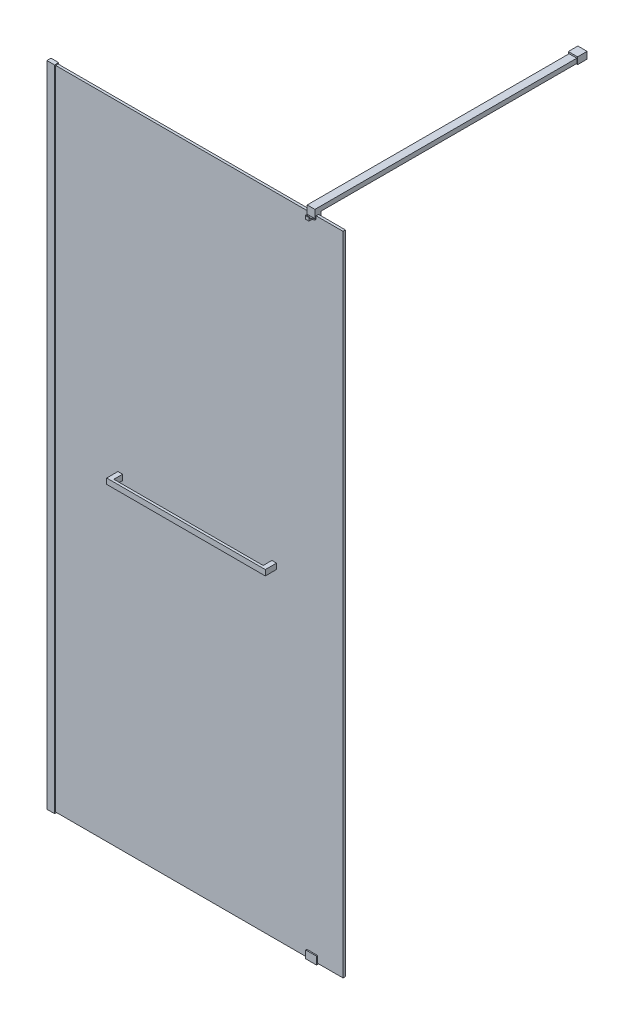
ISO-10303-21;
HEADER;
FILE_DESCRIPTION(('STEP AP214'),'2;1');
FILE_NAME('part.step','',(''),(''),'','','');
FILE_SCHEMA(('AUTOMOTIVE_DESIGN { 1 0 10303 214 1 1 1 1 }'));
ENDSEC;
DATA;
#1=APPLICATION_CONTEXT('core data for automotive mechanical design processes');
#2=APPLICATION_PROTOCOL_DEFINITION('international standard','automotive_design',2000,#1);
#3=PRODUCT_CONTEXT('',#1,'mechanical');
#4=PRODUCT('Part','Part','',(#3));
#5=PRODUCT_RELATED_PRODUCT_CATEGORY('part','',(#4));
#6=PRODUCT_DEFINITION_FORMATION('','',#4);
#7=PRODUCT_DEFINITION_CONTEXT('part definition',#1,'design');
#8=PRODUCT_DEFINITION('design','',#6,#7);
#9=PRODUCT_DEFINITION_SHAPE('','',#8);
#10=(LENGTH_UNIT() NAMED_UNIT(*) SI_UNIT(.MILLI.,.METRE.));
#11=(NAMED_UNIT(*) PLANE_ANGLE_UNIT() SI_UNIT($,.RADIAN.));
#12=(NAMED_UNIT(*) SI_UNIT($,.STERADIAN.) SOLID_ANGLE_UNIT());
#13=UNCERTAINTY_MEASURE_WITH_UNIT(LENGTH_MEASURE(1.E-05),#10,'distance_accuracy_value','');
#14=(GEOMETRIC_REPRESENTATION_CONTEXT(3) GLOBAL_UNCERTAINTY_ASSIGNED_CONTEXT((#13)) GLOBAL_UNIT_ASSIGNED_CONTEXT((#10,
#11,#12)) REPRESENTATION_CONTEXT('',''));
#15=CARTESIAN_POINT('',(0.,0.,0.));
#16=DIRECTION('',(0.,0.,1.));
#17=DIRECTION('',(1.,0.,0.));
#18=AXIS2_PLACEMENT_3D('',#15,#16,#17);
#19=CARTESIAN_POINT('',(742.45,1045.72,-21.6));
#20=DIRECTION('',(1.,0.,0.));
#21=DIRECTION('',(0.,0.,-1.));
#22=AXIS2_PLACEMENT_3D('',#19,#20,#21);
#23=PLANE('',#22);
#24=DIRECTION('',(0.,0.,-1.));
#25=VECTOR('',#24,1.);
#26=CARTESIAN_POINT('',(742.45,1053.72,-21.6));
#27=LINE('',#26,#25);
#28=CARTESIAN_POINT('',(742.45,1053.72,-21.6));
#29=VERTEX_POINT('',#28);
#30=CARTESIAN_POINT('',(742.45,1053.72,-101.6));
#31=VERTEX_POINT('',#30);
#32=EDGE_CURVE('E110',#29,#31,#27,.T.);
#33=ORIENTED_EDGE('',*,*,#32,.F.);
#34=DIRECTION('',(0.,1.,0.));
#35=VECTOR('',#34,1.);
#36=CARTESIAN_POINT('',(742.45,1045.72,-21.6));
#37=LINE('',#36,#35);
#38=CARTESIAN_POINT('',(742.45,1045.72,-21.6));
#39=VERTEX_POINT('',#38);
#40=EDGE_CURVE('E12',#39,#29,#37,.T.);
#41=ORIENTED_EDGE('',*,*,#40,.F.);
#42=DIRECTION('',(0.,0.,-1.));
#43=VECTOR('',#42,1.);
#44=CARTESIAN_POINT('',(742.45,1045.72,-21.6));
#45=LINE('',#44,#43);
#46=CARTESIAN_POINT('',(742.45,1045.72,-101.6));
#47=VERTEX_POINT('',#46);
#48=EDGE_CURVE('E104',#39,#47,#45,.T.);
#49=ORIENTED_EDGE('',*,*,#48,.T.);
#50=DIRECTION('',(0.,1.,0.));
#51=VECTOR('',#50,1.);
#52=CARTESIAN_POINT('',(742.45,1045.72,-101.6));
#53=LINE('',#52,#51);
#54=EDGE_CURVE('E49',#47,#31,#53,.T.);
#55=ORIENTED_EDGE('',*,*,#54,.T.);
#56=EDGE_LOOP('',(#33,#41,#49,#55));
#57=FACE_BOUND('',#56,.T.);
#58=ADVANCED_FACE('F46',(#57),#23,.T.);
#59=CARTESIAN_POINT('',(742.45,1045.72,-21.6));
#60=DIRECTION('',(0.,0.,1.));
#61=DIRECTION('',(1.,0.,0.));
#62=AXIS2_PLACEMENT_3D('',#59,#60,#61);
#63=PLANE('',#62);
#64=DIRECTION('',(1.,0.,0.));
#65=VECTOR('',#64,1.);
#66=CARTESIAN_POINT('',(742.45,1053.72,-21.6));
#67=LINE('',#66,#65);
#68=CARTESIAN_POINT('',(227.45,1053.72,-21.5999999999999));
#69=VERTEX_POINT('',#68);
#70=EDGE_CURVE('E106',#69,#29,#67,.T.);
#71=ORIENTED_EDGE('',*,*,#70,.F.);
#72=DIRECTION('',(0.,1.,0.));
#73=VECTOR('',#72,1.);
#74=CARTESIAN_POINT('',(227.45,1045.72,-21.5999999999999));
#75=LINE('',#74,#73);
#76=CARTESIAN_POINT('',(227.45,1045.72,-21.5999999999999));
#77=VERTEX_POINT('',#76);
#78=EDGE_CURVE('E55',#77,#69,#75,.T.);
#79=ORIENTED_EDGE('',*,*,#78,.F.);
#80=DIRECTION('',(1.,0.,0.));
#81=VECTOR('',#80,1.);
#82=CARTESIAN_POINT('',(742.45,1045.72,-21.6));
#83=LINE('',#82,#81);
#84=EDGE_CURVE('E101',#77,#39,#83,.T.);
#85=ORIENTED_EDGE('',*,*,#84,.T.);
#86=ORIENTED_EDGE('',*,*,#40,.T.);
#87=EDGE_LOOP('',(#71,#79,#85,#86));
#88=FACE_BOUND('',#87,.T.);
#89=ADVANCED_FACE('F120',(#88),#63,.T.);
#90=CARTESIAN_POINT('',(227.45,1045.72,-21.5999999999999));
#91=DIRECTION('',(-1.,0.,0.));
#92=DIRECTION('',(0.,0.,1.));
#93=AXIS2_PLACEMENT_3D('',#90,#91,#92);
#94=PLANE('',#93);
#95=DIRECTION('',(0.,0.,1.));
#96=VECTOR('',#95,1.);
#97=CARTESIAN_POINT('',(227.45,1053.72,-21.5999999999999));
#98=LINE('',#97,#96);
#99=CARTESIAN_POINT('',(227.45,1053.72,-101.6));
#100=VERTEX_POINT('',#99);
#101=EDGE_CURVE('E96',#100,#69,#98,.T.);
#102=ORIENTED_EDGE('',*,*,#101,.F.);
#103=DIRECTION('',(0.,1.,0.));
#104=VECTOR('',#103,1.);
#105=CARTESIAN_POINT('',(227.45,1045.72,-101.6));
#106=LINE('',#105,#104);
#107=CARTESIAN_POINT('',(227.45,1045.72,-101.6));
#108=VERTEX_POINT('',#107);
#109=EDGE_CURVE('E91',#108,#100,#106,.T.);
#110=ORIENTED_EDGE('',*,*,#109,.F.);
#111=DIRECTION('',(0.,0.,1.));
#112=VECTOR('',#111,1.);
#113=CARTESIAN_POINT('',(227.45,1045.72,-21.5999999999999));
#114=LINE('',#113,#112);
#115=EDGE_CURVE('E94',#108,#77,#114,.T.);
#116=ORIENTED_EDGE('',*,*,#115,.T.);
#117=ORIENTED_EDGE('',*,*,#78,.T.);
#118=EDGE_LOOP('',(#102,#110,#116,#117));
#119=FACE_BOUND('',#118,.T.);
#120=ADVANCED_FACE('F93',(#119),#94,.T.);
#121=CARTESIAN_POINT('',(742.45,1045.72,-101.6));
#122=DIRECTION('',(0.,0.,-1.));
#123=DIRECTION('',(-1.,0.,0.));
#124=AXIS2_PLACEMENT_3D('',#121,#122,#123);
#125=PLANE('',#124);
#126=DIRECTION('',(-1.,0.,0.));
#127=VECTOR('',#126,1.);
#128=CARTESIAN_POINT('',(742.45,1053.72,-101.6));
#129=LINE('',#128,#127);
#130=EDGE_CURVE('E113',#31,#100,#129,.T.);
#131=ORIENTED_EDGE('',*,*,#130,.F.);
#132=ORIENTED_EDGE('',*,*,#54,.F.);
#133=DIRECTION('',(-1.,0.,0.));
#134=VECTOR('',#133,1.);
#135=CARTESIAN_POINT('',(742.45,1045.72,-101.6));
#136=LINE('',#135,#134);
#137=EDGE_CURVE('E100',#47,#108,#136,.T.);
#138=ORIENTED_EDGE('',*,*,#137,.T.);
#139=ORIENTED_EDGE('',*,*,#109,.T.);
#140=EDGE_LOOP('',(#131,#132,#138,#139));
#141=FACE_BOUND('',#140,.T.);
#142=ADVANCED_FACE('F103',(#141),#125,.T.);
#143=CARTESIAN_POINT('',(742.45,1045.72,-101.6));
#144=DIRECTION('',(0.,1.,0.));
#145=DIRECTION('',(0.,0.,1.));
#146=AXIS2_PLACEMENT_3D('',#143,#144,#145);
#147=PLANE('',#146);
#148=ORIENTED_EDGE('',*,*,#48,.F.);
#149=ORIENTED_EDGE('',*,*,#84,.F.);
#150=ORIENTED_EDGE('',*,*,#115,.F.);
#151=ORIENTED_EDGE('',*,*,#137,.F.);
#152=EDGE_LOOP('',(#148,#149,#150,#151));
#153=FACE_BOUND('',#152,.T.);
#154=ADVANCED_FACE('F99',(#153),#147,.F.);
#155=CARTESIAN_POINT('',(742.45,1053.72,-101.6));
#156=DIRECTION('',(0.,1.,0.));
#157=DIRECTION('',(0.,0.,1.));
#158=AXIS2_PLACEMENT_3D('',#155,#156,#157);
#159=PLANE('',#158);
#160=ORIENTED_EDGE('',*,*,#32,.T.);
#161=ORIENTED_EDGE('',*,*,#130,.T.);
#162=ORIENTED_EDGE('',*,*,#101,.T.);
#163=ORIENTED_EDGE('',*,*,#70,.T.);
#164=EDGE_LOOP('',(#160,#161,#162,#163));
#165=FACE_BOUND('',#164,.T.);
#166=ADVANCED_FACE('F119',(#165),#159,.T.);
#167=CLOSED_SHELL('',(#58,#89,#120,#142,#154,#166));
#168=MANIFOLD_SOLID_BREP('B2',#167);
#169=CARTESIAN_POINT('',(242.45,1041.,-34.4));
#170=DIRECTION('',(0.,0.,1.));
#171=DIRECTION('',(1.,0.,0.));
#172=AXIS2_PLACEMENT_3D('',#169,#170,#171);
#173=PLANE('',#172);
#174=DIRECTION('',(0.,-1.,0.));
#175=VECTOR('',#174,1.);
#176=CARTESIAN_POINT('',(227.45,1059.,-34.4));
#177=LINE('',#176,#175);
#178=CARTESIAN_POINT('',(227.45,1045.73,-34.4));
#179=VERTEX_POINT('',#178);
#180=CARTESIAN_POINT('',(227.45,1041.,-34.4));
#181=VERTEX_POINT('',#180);
#182=EDGE_CURVE('E415',#179,#181,#177,.T.);
#183=ORIENTED_EDGE('',*,*,#182,.F.);
#184=DIRECTION('',(1.,0.,0.));
#185=VECTOR('',#184,1.);
#186=CARTESIAN_POINT('',(242.45,1045.73,-34.4));
#187=LINE('',#186,#185);
#188=CARTESIAN_POINT('',(242.45,1045.73,-34.4));
#189=VERTEX_POINT('',#188);
#190=EDGE_CURVE('E44',#179,#189,#187,.T.);
#191=ORIENTED_EDGE('',*,*,#190,.T.);
#192=DIRECTION('',(0.,1.,0.));
#193=VECTOR('',#192,1.);
#194=CARTESIAN_POINT('',(242.45,1059.,-34.4));
#195=LINE('',#194,#193);
#196=CARTESIAN_POINT('',(242.45,1041.,-34.4));
#197=VERTEX_POINT('',#196);
#198=EDGE_CURVE('E420',#197,#189,#195,.T.);
#199=ORIENTED_EDGE('',*,*,#198,.F.);
#200=DIRECTION('',(1.,0.,0.));
#201=VECTOR('',#200,1.);
#202=CARTESIAN_POINT('',(227.45,1041.,-34.4));
#203=LINE('',#202,#201);
#204=EDGE_CURVE('E394',#181,#197,#203,.T.);
#205=ORIENTED_EDGE('',*,*,#204,.F.);
#206=EDGE_LOOP('',(#183,#191,#199,#205));
#207=FACE_BOUND('',#206,.T.);
#208=ADVANCED_FACE('F180',(#207),#173,.F.);
#209=CARTESIAN_POINT('',(242.45,1059.,-34.4));
#210=DIRECTION('',(1.,0.,0.));
#211=DIRECTION('',(0.,0.,-1.));
#212=AXIS2_PLACEMENT_3D('',#209,#210,#211);
#213=PLANE('',#212);
#214=DIRECTION('',(0.,1.,0.));
#215=VECTOR('',#214,1.);
#216=CARTESIAN_POINT('',(242.45,1059.,25.1));
#217=LINE('',#216,#215);
#218=CARTESIAN_POINT('',(242.45,1041.,25.1));
#219=VERTEX_POINT('',#218);
#220=CARTESIAN_POINT('',(242.45,1059.,25.1));
#221=VERTEX_POINT('',#220);
#222=EDGE_CURVE('E198',#219,#221,#217,.T.);
#223=ORIENTED_EDGE('',*,*,#222,.F.);
#224=DIRECTION('',(0.,0.,1.));
#225=VECTOR('',#224,1.);
#226=CARTESIAN_POINT('',(242.45,1041.,-34.4));
#227=LINE('',#226,#225);
#228=EDGE_CURVE('E385',#197,#219,#227,.T.);
#229=ORIENTED_EDGE('',*,*,#228,.F.);
#230=ORIENTED_EDGE('',*,*,#198,.T.);
#231=DIRECTION('',(0.,0.,-1.));
#232=VECTOR('',#231,1.);
#233=CARTESIAN_POINT('',(242.45,1045.73,-34.4));
#234=LINE('',#233,#232);
#235=CARTESIAN_POINT('',(242.45,1045.73,-21.6));
#236=VERTEX_POINT('',#235);
#237=EDGE_CURVE('E433',#236,#189,#234,.T.);
#238=ORIENTED_EDGE('',*,*,#237,.F.);
#239=DIRECTION('',(0.,-1.,0.));
#240=VECTOR('',#239,1.);
#241=CARTESIAN_POINT('',(242.45,1059.,-21.6));
#242=LINE('',#241,#240);
#243=CARTESIAN_POINT('',(242.45,1053.73,-21.6));
#244=VERTEX_POINT('',#243);
#245=EDGE_CURVE('E431',#244,#236,#242,.T.);
#246=ORIENTED_EDGE('',*,*,#245,.F.);
#247=DIRECTION('',(0.,0.,1.));
#248=VECTOR('',#247,1.);
#249=CARTESIAN_POINT('',(242.45,1053.73,-34.4));
#250=LINE('',#249,#248);
#251=CARTESIAN_POINT('',(242.45,1053.73,-34.4));
#252=VERTEX_POINT('',#251);
#253=EDGE_CURVE('E435',#252,#244,#250,.T.);
#254=ORIENTED_EDGE('',*,*,#253,.F.);
#255=CARTESIAN_POINT('',(242.45,1059.,-34.4));
#256=VERTEX_POINT('',#255);
#257=EDGE_CURVE('E408',#252,#256,#195,.T.);
#258=ORIENTED_EDGE('',*,*,#257,.T.);
#259=DIRECTION('',(0.,0.,1.));
#260=VECTOR('',#259,1.);
#261=CARTESIAN_POINT('',(242.45,1059.,-34.4));
#262=LINE('',#261,#260);
#263=EDGE_CURVE('E389',#256,#221,#262,.T.);
#264=ORIENTED_EDGE('',*,*,#263,.T.);
#265=EDGE_LOOP('',(#223,#229,#230,#238,#246,#254,#258,#264));
#266=FACE_BOUND('',#265,.T.);
#267=ADVANCED_FACE('F182',(#266),#213,.T.);
#268=CARTESIAN_POINT('',(227.45,1041.,-34.4));
#269=DIRECTION('',(0.,-1.,0.));
#270=DIRECTION('',(0.,0.,-1.));
#271=AXIS2_PLACEMENT_3D('',#268,#269,#270);
#272=PLANE('',#271);
#273=ORIENTED_EDGE('',*,*,#228,.T.);
#274=DIRECTION('',(-1.,0.,0.));
#275=VECTOR('',#274,1.);
#276=CARTESIAN_POINT('',(747.147715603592,1041.,25.1));
#277=LINE('',#276,#275);
#278=CARTESIAN_POINT('',(727.45,1041.,25.1));
#279=VERTEX_POINT('',#278);
#280=EDGE_CURVE('E373',#279,#219,#277,.T.);
#281=ORIENTED_EDGE('',*,*,#280,.F.);
#282=DIRECTION('',(0.,0.,1.));
#283=VECTOR('',#282,1.);
#284=CARTESIAN_POINT('',(727.45,1041.,-34.4));
#285=LINE('',#284,#283);
#286=CARTESIAN_POINT('',(727.45,1041.,-34.4));
#287=VERTEX_POINT('',#286);
#288=EDGE_CURVE('E352',#287,#279,#285,.T.);
#289=ORIENTED_EDGE('',*,*,#288,.F.);
#290=DIRECTION('',(1.,0.,0.));
#291=VECTOR('',#290,1.);
#292=CARTESIAN_POINT('',(727.45,1041.,-34.4));
#293=LINE('',#292,#291);
#294=CARTESIAN_POINT('',(742.45,1041.,-34.4));
#295=VERTEX_POINT('',#294);
#296=EDGE_CURVE('E344',#287,#295,#293,.T.);
#297=ORIENTED_EDGE('',*,*,#296,.T.);
#298=DIRECTION('',(0.,0.,1.));
#299=VECTOR('',#298,1.);
#300=CARTESIAN_POINT('',(742.45,1041.,-34.4));
#301=LINE('',#300,#299);
#302=CARTESIAN_POINT('',(742.45,1041.,33.1));
#303=VERTEX_POINT('',#302);
#304=EDGE_CURVE('E348',#295,#303,#301,.T.);
#305=ORIENTED_EDGE('',*,*,#304,.T.);
#306=DIRECTION('',(1.,0.,0.));
#307=VECTOR('',#306,1.);
#308=CARTESIAN_POINT('',(227.45,1041.,33.1));
#309=LINE('',#308,#307);
#310=CARTESIAN_POINT('',(227.45,1041.,33.1));
#311=VERTEX_POINT('',#310);
#312=EDGE_CURVE('E423',#311,#303,#309,.T.);
#313=ORIENTED_EDGE('',*,*,#312,.F.);
#314=DIRECTION('',(0.,0.,1.));
#315=VECTOR('',#314,1.);
#316=CARTESIAN_POINT('',(227.45,1041.,-34.4));
#317=LINE('',#316,#315);
#318=EDGE_CURVE('E388',#181,#311,#317,.T.);
#319=ORIENTED_EDGE('',*,*,#318,.F.);
#320=ORIENTED_EDGE('',*,*,#204,.T.);
#321=EDGE_LOOP('',(#273,#281,#289,#297,#305,#313,#319,#320));
#322=FACE_BOUND('',#321,.T.);
#323=ADVANCED_FACE('F456',(#322),#272,.T.);
#324=CARTESIAN_POINT('',(227.45,1059.,-34.4));
#325=DIRECTION('',(-1.,0.,0.));
#326=DIRECTION('',(0.,0.,1.));
#327=AXIS2_PLACEMENT_3D('',#324,#325,#326);
#328=PLANE('',#327);
#329=DIRECTION('',(0.,0.,1.));
#330=VECTOR('',#329,1.);
#331=CARTESIAN_POINT('',(227.45,1045.73,-34.4));
#332=LINE('',#331,#330);
#333=CARTESIAN_POINT('',(227.45,1045.73,-21.6));
#334=VERTEX_POINT('',#333);
#335=EDGE_CURVE('E379',#179,#334,#332,.T.);
#336=ORIENTED_EDGE('',*,*,#335,.F.);
#337=ORIENTED_EDGE('',*,*,#182,.T.);
#338=ORIENTED_EDGE('',*,*,#318,.T.);
#339=DIRECTION('',(0.,-1.,0.));
#340=VECTOR('',#339,1.);
#341=CARTESIAN_POINT('',(227.45,1059.,33.1));
#342=LINE('',#341,#340);
#343=CARTESIAN_POINT('',(227.45,1059.,33.1));
#344=VERTEX_POINT('',#343);
#345=EDGE_CURVE('E425',#344,#311,#342,.T.);
#346=ORIENTED_EDGE('',*,*,#345,.F.);
#347=DIRECTION('',(0.,0.,1.));
#348=VECTOR('',#347,1.);
#349=CARTESIAN_POINT('',(227.45,1059.,-34.4));
#350=LINE('',#349,#348);
#351=CARTESIAN_POINT('',(227.45,1059.,-34.4));
#352=VERTEX_POINT('',#351);
#353=EDGE_CURVE('E397',#352,#344,#350,.T.);
#354=ORIENTED_EDGE('',*,*,#353,.F.);
#355=CARTESIAN_POINT('',(227.45,1053.73,-34.4));
#356=VERTEX_POINT('',#355);
#357=EDGE_CURVE('E406',#352,#356,#177,.T.);
#358=ORIENTED_EDGE('',*,*,#357,.T.);
#359=DIRECTION('',(0.,0.,-1.));
#360=VECTOR('',#359,1.);
#361=CARTESIAN_POINT('',(227.45,1053.73,-34.4));
#362=LINE('',#361,#360);
#363=CARTESIAN_POINT('',(227.45,1053.73,-21.6));
#364=VERTEX_POINT('',#363);
#365=EDGE_CURVE('E206',#364,#356,#362,.T.);
#366=ORIENTED_EDGE('',*,*,#365,.F.);
#367=DIRECTION('',(0.,1.,0.));
#368=VECTOR('',#367,1.);
#369=CARTESIAN_POINT('',(227.45,1053.73,-21.6));
#370=LINE('',#369,#368);
#371=EDGE_CURVE('E442',#334,#364,#370,.T.);
#372=ORIENTED_EDGE('',*,*,#371,.F.);
#373=EDGE_LOOP('',(#336,#337,#338,#346,#354,#358,#366,#372));
#374=FACE_BOUND('',#373,.T.);
#375=ADVANCED_FACE('F412',(#374),#328,.T.);
#376=CARTESIAN_POINT('',(227.45,1059.,-34.4));
#377=DIRECTION('',(0.,1.,0.));
#378=DIRECTION('',(0.,0.,1.));
#379=AXIS2_PLACEMENT_3D('',#376,#377,#378);
#380=PLANE('',#379);
#381=ORIENTED_EDGE('',*,*,#353,.T.);
#382=DIRECTION('',(-1.,0.,0.));
#383=VECTOR('',#382,1.);
#384=CARTESIAN_POINT('',(227.45,1059.,33.1));
#385=LINE('',#384,#383);
#386=CARTESIAN_POINT('',(742.45,1059.,33.1));
#387=VERTEX_POINT('',#386);
#388=EDGE_CURVE('E428',#387,#344,#385,.T.);
#389=ORIENTED_EDGE('',*,*,#388,.F.);
#390=DIRECTION('',(0.,0.,1.));
#391=VECTOR('',#390,1.);
#392=CARTESIAN_POINT('',(742.45,1059.,-34.4));
#393=LINE('',#392,#391);
#394=CARTESIAN_POINT('',(742.45,1059.,-34.4));
#395=VERTEX_POINT('',#394);
#396=EDGE_CURVE('E347',#395,#387,#393,.T.);
#397=ORIENTED_EDGE('',*,*,#396,.F.);
#398=DIRECTION('',(-1.,0.,0.));
#399=VECTOR('',#398,1.);
#400=CARTESIAN_POINT('',(727.45,1059.,-34.4));
#401=LINE('',#400,#399);
#402=CARTESIAN_POINT('',(727.45,1059.,-34.4));
#403=VERTEX_POINT('',#402);
#404=EDGE_CURVE('E337',#395,#403,#401,.T.);
#405=ORIENTED_EDGE('',*,*,#404,.T.);
#406=DIRECTION('',(0.,0.,1.));
#407=VECTOR('',#406,1.);
#408=CARTESIAN_POINT('',(727.45,1059.,-34.4));
#409=LINE('',#408,#407);
#410=CARTESIAN_POINT('',(727.45,1059.,25.1));
#411=VERTEX_POINT('',#410);
#412=EDGE_CURVE('E360',#403,#411,#409,.T.);
#413=ORIENTED_EDGE('',*,*,#412,.T.);
#414=DIRECTION('',(-1.,0.,0.));
#415=VECTOR('',#414,1.);
#416=CARTESIAN_POINT('',(747.147715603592,1059.,25.1));
#417=LINE('',#416,#415);
#418=EDGE_CURVE('E370',#411,#221,#417,.T.);
#419=ORIENTED_EDGE('',*,*,#418,.T.);
#420=ORIENTED_EDGE('',*,*,#263,.F.);
#421=DIRECTION('',(-1.,0.,0.));
#422=VECTOR('',#421,1.);
#423=CARTESIAN_POINT('',(227.45,1059.,-34.4));
#424=LINE('',#423,#422);
#425=EDGE_CURVE('E417',#256,#352,#424,.T.);
#426=ORIENTED_EDGE('',*,*,#425,.T.);
#427=EDGE_LOOP('',(#381,#389,#397,#405,#413,#419,#420,#426));
#428=FACE_BOUND('',#427,.T.);
#429=ADVANCED_FACE('F463',(#428),#380,.T.);
#430=ORIENTED_EDGE('',*,*,#257,.F.);
#431=DIRECTION('',(-1.,0.,0.));
#432=VECTOR('',#431,1.);
#433=CARTESIAN_POINT('',(242.45,1053.73,-34.4));
#434=LINE('',#433,#432);
#435=EDGE_CURVE('E190',#252,#356,#434,.T.);
#436=ORIENTED_EDGE('',*,*,#435,.T.);
#437=ORIENTED_EDGE('',*,*,#357,.F.);
#438=ORIENTED_EDGE('',*,*,#425,.F.);
#439=EDGE_LOOP('',(#430,#436,#437,#438));
#440=FACE_BOUND('',#439,.T.);
#441=ADVANCED_FACE('F404',(#440),#173,.F.);
#442=CARTESIAN_POINT('',(242.45,1041.,33.1));
#443=DIRECTION('',(0.,0.,1.));
#444=DIRECTION('',(1.,0.,0.));
#445=AXIS2_PLACEMENT_3D('',#442,#443,#444);
#446=PLANE('',#445);
#447=ORIENTED_EDGE('',*,*,#312,.T.);
#448=DIRECTION('',(0.,1.,0.));
#449=VECTOR('',#448,1.);
#450=CARTESIAN_POINT('',(742.45,1059.,33.1));
#451=LINE('',#450,#449);
#452=EDGE_CURVE('E332',#303,#387,#451,.T.);
#453=ORIENTED_EDGE('',*,*,#452,.T.);
#454=ORIENTED_EDGE('',*,*,#388,.T.);
#455=ORIENTED_EDGE('',*,*,#345,.T.);
#456=EDGE_LOOP('',(#447,#453,#454,#455));
#457=FACE_BOUND('',#456,.T.);
#458=ADVANCED_FACE('F459',(#457),#446,.T.);
#459=CARTESIAN_POINT('',(757.54436981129,1045.73,-34.4));
#460=DIRECTION('',(0.,-1.,0.));
#461=DIRECTION('',(0.,0.,-1.));
#462=AXIS2_PLACEMENT_3D('',#459,#460,#461);
#463=PLANE('',#462);
#464=ORIENTED_EDGE('',*,*,#237,.T.);
#465=ORIENTED_EDGE('',*,*,#190,.F.);
#466=ORIENTED_EDGE('',*,*,#335,.T.);
#467=DIRECTION('',(-1.,0.,0.));
#468=VECTOR('',#467,1.);
#469=CARTESIAN_POINT('',(757.54436981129,1045.73,-21.6));
#470=LINE('',#469,#468);
#471=EDGE_CURVE('E438',#236,#334,#470,.T.);
#472=ORIENTED_EDGE('',*,*,#471,.F.);
#473=EDGE_LOOP('',(#464,#465,#466,#472));
#474=FACE_BOUND('',#473,.T.);
#475=ADVANCED_FACE('F498',(#474),#463,.F.);
#476=CARTESIAN_POINT('',(757.54436981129,1053.73,-21.6));
#477=DIRECTION('',(0.,0.,1.));
#478=DIRECTION('',(1.,0.,0.));
#479=AXIS2_PLACEMENT_3D('',#476,#477,#478);
#480=PLANE('',#479);
#481=ORIENTED_EDGE('',*,*,#245,.T.);
#482=ORIENTED_EDGE('',*,*,#471,.T.);
#483=ORIENTED_EDGE('',*,*,#371,.T.);
#484=DIRECTION('',(-1.,0.,0.));
#485=VECTOR('',#484,1.);
#486=CARTESIAN_POINT('',(757.54436981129,1053.73,-21.6));
#487=LINE('',#486,#485);
#488=EDGE_CURVE('E437',#244,#364,#487,.T.);
#489=ORIENTED_EDGE('',*,*,#488,.F.);
#490=EDGE_LOOP('',(#481,#482,#483,#489));
#491=FACE_BOUND('',#490,.T.);
#492=ADVANCED_FACE('F446',(#491),#480,.F.);
#493=CARTESIAN_POINT('',(757.54436981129,1053.73,-34.4));
#494=DIRECTION('',(0.,1.,0.));
#495=DIRECTION('',(0.,0.,1.));
#496=AXIS2_PLACEMENT_3D('',#493,#494,#495);
#497=PLANE('',#496);
#498=ORIENTED_EDGE('',*,*,#253,.T.);
#499=ORIENTED_EDGE('',*,*,#488,.T.);
#500=ORIENTED_EDGE('',*,*,#365,.T.);
#501=ORIENTED_EDGE('',*,*,#435,.F.);
#502=EDGE_LOOP('',(#498,#499,#500,#501));
#503=FACE_BOUND('',#502,.T.);
#504=ADVANCED_FACE('F538',(#503),#497,.F.);
#505=CARTESIAN_POINT('',(747.147715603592,1059.,25.1));
#506=DIRECTION('',(0.,0.,1.));
#507=DIRECTION('',(0.,-1.,0.));
#508=AXIS2_PLACEMENT_3D('',#505,#506,#507);
#509=PLANE('',#508);
#510=ORIENTED_EDGE('',*,*,#418,.F.);
#511=DIRECTION('',(0.,-1.,0.));
#512=VECTOR('',#511,1.);
#513=CARTESIAN_POINT('',(727.45,1059.,25.1));
#514=LINE('',#513,#512);
#515=EDGE_CURVE('E184',#411,#279,#514,.T.);
#516=ORIENTED_EDGE('',*,*,#515,.T.);
#517=ORIENTED_EDGE('',*,*,#280,.T.);
#518=ORIENTED_EDGE('',*,*,#222,.T.);
#519=EDGE_LOOP('',(#510,#516,#517,#518));
#520=FACE_BOUND('',#519,.T.);
#521=ADVANCED_FACE('F470',(#520),#509,.F.);
#522=CARTESIAN_POINT('',(727.45,1059.,-34.4));
#523=DIRECTION('',(-1.,0.,0.));
#524=DIRECTION('',(0.,0.,1.));
#525=AXIS2_PLACEMENT_3D('',#522,#523,#524);
#526=PLANE('',#525);
#527=ORIENTED_EDGE('',*,*,#515,.F.);
#528=ORIENTED_EDGE('',*,*,#412,.F.);
#529=DIRECTION('',(0.,-1.,0.));
#530=VECTOR('',#529,1.);
#531=CARTESIAN_POINT('',(727.45,1059.,-34.4));
#532=LINE('',#531,#530);
#533=CARTESIAN_POINT('',(727.45,1053.73,-34.4));
#534=VERTEX_POINT('',#533);
#535=EDGE_CURVE('E341',#403,#534,#532,.T.);
#536=ORIENTED_EDGE('',*,*,#535,.T.);
#537=DIRECTION('',(0.,0.,-1.));
#538=VECTOR('',#537,1.);
#539=CARTESIAN_POINT('',(727.45,1053.73,-34.4));
#540=LINE('',#539,#538);
#541=CARTESIAN_POINT('',(727.45,1053.73,-21.6));
#542=VERTEX_POINT('',#541);
#543=EDGE_CURVE('E329',#542,#534,#540,.T.);
#544=ORIENTED_EDGE('',*,*,#543,.F.);
#545=DIRECTION('',(0.,1.,0.));
#546=VECTOR('',#545,1.);
#547=CARTESIAN_POINT('',(727.45,1059.,-21.6));
#548=LINE('',#547,#546);
#549=CARTESIAN_POINT('',(727.45,1045.73,-21.6));
#550=VERTEX_POINT('',#549);
#551=EDGE_CURVE('E351',#550,#542,#548,.T.);
#552=ORIENTED_EDGE('',*,*,#551,.F.);
#553=DIRECTION('',(0.,0.,1.));
#554=VECTOR('',#553,1.);
#555=CARTESIAN_POINT('',(727.45,1045.73,-34.4));
#556=LINE('',#555,#554);
#557=CARTESIAN_POINT('',(727.45,1045.73,-34.4));
#558=VERTEX_POINT('',#557);
#559=EDGE_CURVE('E313',#558,#550,#556,.T.);
#560=ORIENTED_EDGE('',*,*,#559,.F.);
#561=EDGE_CURVE('E340',#558,#287,#532,.T.);
#562=ORIENTED_EDGE('',*,*,#561,.T.);
#563=ORIENTED_EDGE('',*,*,#288,.T.);
#564=EDGE_LOOP('',(#527,#528,#536,#544,#552,#560,#562,#563));
#565=FACE_BOUND('',#564,.T.);
#566=ADVANCED_FACE('F471',(#565),#526,.T.);
#567=CARTESIAN_POINT('',(742.45,1041.,-34.4));
#568=DIRECTION('',(0.,0.,1.));
#569=DIRECTION('',(1.,0.,0.));
#570=AXIS2_PLACEMENT_3D('',#567,#568,#569);
#571=PLANE('',#570);
#572=ORIENTED_EDGE('',*,*,#561,.F.);
#573=DIRECTION('',(-1.,0.,0.));
#574=VECTOR('',#573,1.);
#575=CARTESIAN_POINT('',(757.54436981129,1045.73,-34.4));
#576=LINE('',#575,#574);
#577=CARTESIAN_POINT('',(742.45,1045.73,-34.4));
#578=VERTEX_POINT('',#577);
#579=EDGE_CURVE('E326',#578,#558,#576,.T.);
#580=ORIENTED_EDGE('',*,*,#579,.F.);
#581=DIRECTION('',(0.,1.,0.));
#582=VECTOR('',#581,1.);
#583=CARTESIAN_POINT('',(742.45,1059.,-34.4));
#584=LINE('',#583,#582);
#585=EDGE_CURVE('E318',#295,#578,#584,.T.);
#586=ORIENTED_EDGE('',*,*,#585,.F.);
#587=ORIENTED_EDGE('',*,*,#296,.F.);
#588=EDGE_LOOP('',(#572,#580,#586,#587));
#589=FACE_BOUND('',#588,.T.);
#590=ADVANCED_FACE('F476',(#589),#571,.F.);
#591=CARTESIAN_POINT('',(742.45,1059.,-34.4));
#592=DIRECTION('',(1.,0.,0.));
#593=DIRECTION('',(0.,0.,-1.));
#594=AXIS2_PLACEMENT_3D('',#591,#592,#593);
#595=PLANE('',#594);
#596=DIRECTION('',(0.,0.,1.));
#597=VECTOR('',#596,1.);
#598=CARTESIAN_POINT('',(742.45,1045.73,-34.4));
#599=LINE('',#598,#597);
#600=CARTESIAN_POINT('',(742.45,1045.73,-21.6));
#601=VERTEX_POINT('',#600);
#602=EDGE_CURVE('E310',#578,#601,#599,.T.);
#603=ORIENTED_EDGE('',*,*,#602,.T.);
#604=DIRECTION('',(0.,1.,0.));
#605=VECTOR('',#604,1.);
#606=CARTESIAN_POINT('',(742.45,1053.73,-21.6));
#607=LINE('',#606,#605);
#608=CARTESIAN_POINT('',(742.45,1053.73,-21.6));
#609=VERTEX_POINT('',#608);
#610=EDGE_CURVE('E297',#601,#609,#607,.T.);
#611=ORIENTED_EDGE('',*,*,#610,.T.);
#612=DIRECTION('',(0.,0.,-1.));
#613=VECTOR('',#612,1.);
#614=CARTESIAN_POINT('',(742.45,1053.73,-34.4));
#615=LINE('',#614,#613);
#616=CARTESIAN_POINT('',(742.45,1053.73,-34.4));
#617=VERTEX_POINT('',#616);
#618=EDGE_CURVE('E321',#609,#617,#615,.T.);
#619=ORIENTED_EDGE('',*,*,#618,.T.);
#620=EDGE_CURVE('E335',#617,#395,#584,.T.);
#621=ORIENTED_EDGE('',*,*,#620,.T.);
#622=ORIENTED_EDGE('',*,*,#396,.T.);
#623=ORIENTED_EDGE('',*,*,#452,.F.);
#624=ORIENTED_EDGE('',*,*,#304,.F.);
#625=ORIENTED_EDGE('',*,*,#585,.T.);
#626=EDGE_LOOP('',(#603,#611,#619,#621,#622,#623,#624,#625));
#627=FACE_BOUND('',#626,.T.);
#628=ADVANCED_FACE('F316',(#627),#595,.T.);
#629=ORIENTED_EDGE('',*,*,#620,.F.);
#630=DIRECTION('',(-1.,0.,0.));
#631=VECTOR('',#630,1.);
#632=CARTESIAN_POINT('',(757.54436981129,1053.73,-34.4));
#633=LINE('',#632,#631);
#634=EDGE_CURVE('E322',#617,#534,#633,.T.);
#635=ORIENTED_EDGE('',*,*,#634,.T.);
#636=ORIENTED_EDGE('',*,*,#535,.F.);
#637=ORIENTED_EDGE('',*,*,#404,.F.);
#638=EDGE_LOOP('',(#629,#635,#636,#637));
#639=FACE_BOUND('',#638,.T.);
#640=ADVANCED_FACE('F467',(#639),#571,.F.);
#641=CARTESIAN_POINT('',(757.54436981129,1045.73,-34.4));
#642=DIRECTION('',(0.,-1.,0.));
#643=DIRECTION('',(0.,0.,-1.));
#644=AXIS2_PLACEMENT_3D('',#641,#642,#643);
#645=PLANE('',#644);
#646=ORIENTED_EDGE('',*,*,#559,.T.);
#647=DIRECTION('',(-1.,0.,0.));
#648=VECTOR('',#647,1.);
#649=CARTESIAN_POINT('',(757.54436981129,1045.73,-21.6));
#650=LINE('',#649,#648);
#651=EDGE_CURVE('E300',#601,#550,#650,.T.);
#652=ORIENTED_EDGE('',*,*,#651,.F.);
#653=ORIENTED_EDGE('',*,*,#602,.F.);
#654=ORIENTED_EDGE('',*,*,#579,.T.);
#655=EDGE_LOOP('',(#646,#652,#653,#654));
#656=FACE_BOUND('',#655,.T.);
#657=ADVANCED_FACE('F309',(#656),#645,.F.);
#658=CARTESIAN_POINT('',(757.54436981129,1053.73,-21.6));
#659=DIRECTION('',(0.,0.,1.));
#660=DIRECTION('',(1.,0.,0.));
#661=AXIS2_PLACEMENT_3D('',#658,#659,#660);
#662=PLANE('',#661);
#663=ORIENTED_EDGE('',*,*,#551,.T.);
#664=DIRECTION('',(-1.,0.,0.));
#665=VECTOR('',#664,1.);
#666=CARTESIAN_POINT('',(757.54436981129,1053.73,-21.6));
#667=LINE('',#666,#665);
#668=EDGE_CURVE('E303',#609,#542,#667,.T.);
#669=ORIENTED_EDGE('',*,*,#668,.F.);
#670=ORIENTED_EDGE('',*,*,#610,.F.);
#671=ORIENTED_EDGE('',*,*,#651,.T.);
#672=EDGE_LOOP('',(#663,#669,#670,#671));
#673=FACE_BOUND('',#672,.T.);
#674=ADVANCED_FACE('F299',(#673),#662,.F.);
#675=CARTESIAN_POINT('',(757.54436981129,1053.73,-34.4));
#676=DIRECTION('',(0.,1.,0.));
#677=DIRECTION('',(0.,0.,1.));
#678=AXIS2_PLACEMENT_3D('',#675,#676,#677);
#679=PLANE('',#678);
#680=ORIENTED_EDGE('',*,*,#543,.T.);
#681=ORIENTED_EDGE('',*,*,#634,.F.);
#682=ORIENTED_EDGE('',*,*,#618,.F.);
#683=ORIENTED_EDGE('',*,*,#668,.T.);
#684=EDGE_LOOP('',(#680,#681,#682,#683));
#685=FACE_BOUND('',#684,.T.);
#686=ADVANCED_FACE('F479',(#685),#679,.F.);
#687=CLOSED_SHELL('',(#208,#267,#323,#375,#429,#441,#458,#475,#492,#504,#521,#566,#590,#628,
#640,#657,#674,#686));
#688=MANIFOLD_SOLID_BREP('B6',#687);
#689=CARTESIAN_POINT('',(870.95,2090.,-19.4000000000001));
#690=DIRECTION('',(-1.,0.,0.));
#691=DIRECTION('',(0.,0.,1.));
#692=AXIS2_PLACEMENT_3D('',#689,#690,#691);
#693=PLANE('',#692);
#694=DIRECTION('',(0.,-1.,0.));
#695=VECTOR('',#694,1.);
#696=CARTESIAN_POINT('',(870.95,2090.,-850.03));
#697=LINE('',#696,#695);
#698=CARTESIAN_POINT('',(870.95,2120.,-850.03));
#699=VERTEX_POINT('',#698);
#700=CARTESIAN_POINT('',(870.95,2105.,-850.03));
#701=VERTEX_POINT('',#700);
#702=EDGE_CURVE('E669',#699,#701,#697,.T.);
#703=ORIENTED_EDGE('',*,*,#702,.F.);
#704=DIRECTION('',(0.,0.,1.));
#705=VECTOR('',#704,1.);
#706=CARTESIAN_POINT('',(870.95,2120.,0.599999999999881));
#707=LINE('',#706,#705);
#708=CARTESIAN_POINT('',(870.95,2120.,0.599999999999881));
#709=VERTEX_POINT('',#708);
#710=EDGE_CURVE('E994',#699,#709,#707,.T.);
#711=ORIENTED_EDGE('',*,*,#710,.T.);
#712=DIRECTION('',(0.,-1.,0.));
#713=VECTOR('',#712,1.);
#714=CARTESIAN_POINT('',(870.95,2094.,0.599999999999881));
#715=LINE('',#714,#713);
#716=CARTESIAN_POINT('',(870.95,2094.,0.599999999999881));
#717=VERTEX_POINT('',#716);
#718=EDGE_CURVE('E996',#709,#717,#715,.T.);
#719=ORIENTED_EDGE('',*,*,#718,.T.);
#720=DIRECTION('',(0.,1.,0.));
#721=VECTOR('',#720,1.);
#722=CARTESIAN_POINT('',(870.95,2090.,0.599999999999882));
#723=LINE('',#722,#721);
#724=CARTESIAN_POINT('',(870.95,2090.,0.599999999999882));
#725=VERTEX_POINT('',#724);
#726=EDGE_CURVE('E940',#725,#717,#723,.T.);
#727=ORIENTED_EDGE('',*,*,#726,.F.);
#728=DIRECTION('',(0.,0.,-1.));
#729=VECTOR('',#728,1.);
#730=CARTESIAN_POINT('',(870.95,2090.,-3.40000000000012));
#731=LINE('',#730,#729);
#732=CARTESIAN_POINT('',(870.95,2090.,-3.40000000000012));
#733=VERTEX_POINT('',#732);
#734=EDGE_CURVE('E970',#725,#733,#731,.T.);
#735=ORIENTED_EDGE('',*,*,#734,.T.);
#736=DIRECTION('',(0.,1.,-1.30407837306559E-13));
#737=VECTOR('',#736,1.);
#738=CARTESIAN_POINT('',(870.95,2100.,-3.40000000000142));
#739=LINE('',#738,#737);
#740=CARTESIAN_POINT('',(870.95,2100.,-3.40000000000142));
#741=VERTEX_POINT('',#740);
#742=EDGE_CURVE('E1000',#733,#741,#739,.T.);
#743=ORIENTED_EDGE('',*,*,#742,.T.);
#744=DIRECTION('',(0.,0.,-1.));
#745=VECTOR('',#744,1.);
#746=CARTESIAN_POINT('',(870.95,2100.,-11.4000000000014));
#747=LINE('',#746,#745);
#748=CARTESIAN_POINT('',(870.95,2100.,-11.4000000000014));
#749=VERTEX_POINT('',#748);
#750=EDGE_CURVE('E1002',#741,#749,#747,.T.);
#751=ORIENTED_EDGE('',*,*,#750,.T.);
#752=DIRECTION('',(0.,-1.,1.30451205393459E-13));
#753=VECTOR('',#752,1.);
#754=CARTESIAN_POINT('',(870.95,2090.,-11.4000000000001));
#755=LINE('',#754,#753);
#756=CARTESIAN_POINT('',(870.95,2090.,-11.4000000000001));
#757=VERTEX_POINT('',#756);
#758=EDGE_CURVE('E1003',#749,#757,#755,.T.);
#759=ORIENTED_EDGE('',*,*,#758,.T.);
#760=DIRECTION('',(0.,0.,-1.));
#761=VECTOR('',#760,1.);
#762=CARTESIAN_POINT('',(870.95,2090.,-19.4000000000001));
#763=LINE('',#762,#761);
#764=CARTESIAN_POINT('',(870.95,2090.,-19.4000000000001));
#765=VERTEX_POINT('',#764);
#766=EDGE_CURVE('E891',#757,#765,#763,.T.);
#767=ORIENTED_EDGE('',*,*,#766,.T.);
#768=DIRECTION('',(0.,1.,0.));
#769=VECTOR('',#768,1.);
#770=CARTESIAN_POINT('',(870.95,2120.,-19.4000000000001));
#771=LINE('',#770,#769);
#772=CARTESIAN_POINT('',(870.95,2105.,-19.4000000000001));
#773=VERTEX_POINT('',#772);
#774=EDGE_CURVE('E857',#765,#773,#771,.T.);
#775=ORIENTED_EDGE('',*,*,#774,.T.);
#776=DIRECTION('',(0.,0.,-1.));
#777=VECTOR('',#776,1.);
#778=CARTESIAN_POINT('',(870.95,2105.,-881.03));
#779=LINE('',#778,#777);
#780=EDGE_CURVE('E856',#773,#701,#779,.T.);
#781=ORIENTED_EDGE('',*,*,#780,.T.);
#782=EDGE_LOOP('',(#703,#711,#719,#727,#735,#743,#751,#759,#767,#775,#781));
#783=FACE_BOUND('',#782,.T.);
#784=ADVANCED_FACE('F654',(#783),#693,.F.);
#785=CARTESIAN_POINT('',(845.95,2090.,-19.4000000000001));
#786=DIRECTION('',(-1.,0.,0.));
#787=DIRECTION('',(0.,0.,1.));
#788=AXIS2_PLACEMENT_3D('',#785,#786,#787);
#789=PLANE('',#788);
#790=DIRECTION('',(0.,0.,1.));
#791=VECTOR('',#790,1.);
#792=CARTESIAN_POINT('',(845.95,2120.,0.599999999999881));
#793=LINE('',#792,#791);
#794=CARTESIAN_POINT('',(845.95,2120.,-850.03));
#795=VERTEX_POINT('',#794);
#796=CARTESIAN_POINT('',(845.95,2120.,0.599999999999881));
#797=VERTEX_POINT('',#796);
#798=EDGE_CURVE('E880',#795,#797,#793,.T.);
#799=ORIENTED_EDGE('',*,*,#798,.F.);
#800=DIRECTION('',(0.,-1.,0.));
#801=VECTOR('',#800,1.);
#802=CARTESIAN_POINT('',(845.95,2090.,-850.03));
#803=LINE('',#802,#801);
#804=CARTESIAN_POINT('',(845.95,2105.,-850.03));
#805=VERTEX_POINT('',#804);
#806=EDGE_CURVE('E838',#795,#805,#803,.T.);
#807=ORIENTED_EDGE('',*,*,#806,.T.);
#808=DIRECTION('',(0.,0.,1.));
#809=VECTOR('',#808,1.);
#810=CARTESIAN_POINT('',(845.95,2105.,-881.03));
#811=LINE('',#810,#809);
#812=CARTESIAN_POINT('',(845.95,2105.,-19.4000000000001));
#813=VERTEX_POINT('',#812);
#814=EDGE_CURVE('E846',#805,#813,#811,.T.);
#815=ORIENTED_EDGE('',*,*,#814,.T.);
#816=DIRECTION('',(0.,1.,0.));
#817=VECTOR('',#816,1.);
#818=CARTESIAN_POINT('',(845.95,2120.,-19.4000000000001));
#819=LINE('',#818,#817);
#820=CARTESIAN_POINT('',(845.95,2090.,-19.4000000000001));
#821=VERTEX_POINT('',#820);
#822=EDGE_CURVE('E870',#821,#813,#819,.T.);
#823=ORIENTED_EDGE('',*,*,#822,.F.);
#824=DIRECTION('',(0.,0.,-1.));
#825=VECTOR('',#824,1.);
#826=CARTESIAN_POINT('',(845.95,2090.,-19.4000000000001));
#827=LINE('',#826,#825);
#828=CARTESIAN_POINT('',(845.95,2090.,-11.4000000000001));
#829=VERTEX_POINT('',#828);
#830=EDGE_CURVE('E904',#829,#821,#827,.T.);
#831=ORIENTED_EDGE('',*,*,#830,.F.);
#832=DIRECTION('',(0.,-1.,1.30451205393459E-13));
#833=VECTOR('',#832,1.);
#834=CARTESIAN_POINT('',(845.95,2090.,-11.4000000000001));
#835=LINE('',#834,#833);
#836=CARTESIAN_POINT('',(845.95,2100.,-11.4000000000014));
#837=VERTEX_POINT('',#836);
#838=EDGE_CURVE('E902',#837,#829,#835,.T.);
#839=ORIENTED_EDGE('',*,*,#838,.F.);
#840=DIRECTION('',(0.,0.,-1.));
#841=VECTOR('',#840,1.);
#842=CARTESIAN_POINT('',(845.95,2100.,-11.4000000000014));
#843=LINE('',#842,#841);
#844=CARTESIAN_POINT('',(845.95,2100.,-3.40000000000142));
#845=VERTEX_POINT('',#844);
#846=EDGE_CURVE('E900',#845,#837,#843,.T.);
#847=ORIENTED_EDGE('',*,*,#846,.F.);
#848=DIRECTION('',(0.,1.,-1.30407837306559E-13));
#849=VECTOR('',#848,1.);
#850=CARTESIAN_POINT('',(845.95,2100.,-3.40000000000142));
#851=LINE('',#850,#849);
#852=CARTESIAN_POINT('',(845.95,2090.,-3.40000000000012));
#853=VERTEX_POINT('',#852);
#854=EDGE_CURVE('E898',#853,#845,#851,.T.);
#855=ORIENTED_EDGE('',*,*,#854,.F.);
#856=DIRECTION('',(0.,0.,-1.));
#857=VECTOR('',#856,1.);
#858=CARTESIAN_POINT('',(845.95,2090.,-3.40000000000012));
#859=LINE('',#858,#857);
#860=CARTESIAN_POINT('',(845.95,2090.,0.599999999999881));
#861=VERTEX_POINT('',#860);
#862=EDGE_CURVE('E896',#861,#853,#859,.T.);
#863=ORIENTED_EDGE('',*,*,#862,.F.);
#864=DIRECTION('',(0.,1.,0.));
#865=VECTOR('',#864,1.);
#866=CARTESIAN_POINT('',(845.95,2090.,0.599999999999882));
#867=LINE('',#866,#865);
#868=CARTESIAN_POINT('',(845.95,2094.,0.599999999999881));
#869=VERTEX_POINT('',#868);
#870=EDGE_CURVE('E937',#861,#869,#867,.T.);
#871=ORIENTED_EDGE('',*,*,#870,.T.);
#872=DIRECTION('',(0.,-1.,0.));
#873=VECTOR('',#872,1.);
#874=CARTESIAN_POINT('',(845.95,2094.,0.599999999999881));
#875=LINE('',#874,#873);
#876=EDGE_CURVE('E882',#797,#869,#875,.T.);
#877=ORIENTED_EDGE('',*,*,#876,.F.);
#878=EDGE_LOOP('',(#799,#807,#815,#823,#831,#839,#847,#855,#863,#871,#877));
#879=FACE_BOUND('',#878,.T.);
#880=ADVANCED_FACE('F867',(#879),#789,.T.);
#881=CARTESIAN_POINT('',(870.95,2120.,0.599999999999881));
#882=DIRECTION('',(0.,-1.,0.));
#883=DIRECTION('',(0.,0.,-1.));
#884=AXIS2_PLACEMENT_3D('',#881,#882,#883);
#885=PLANE('',#884);
#886=DIRECTION('',(1.,0.,0.));
#887=VECTOR('',#886,1.);
#888=CARTESIAN_POINT('',(870.95,2120.,-850.03));
#889=LINE('',#888,#887);
#890=EDGE_CURVE('E676',#795,#699,#889,.T.);
#891=ORIENTED_EDGE('',*,*,#890,.F.);
#892=ORIENTED_EDGE('',*,*,#798,.T.);
#893=DIRECTION('',(-1.,0.,0.));
#894=VECTOR('',#893,1.);
#895=CARTESIAN_POINT('',(870.95,2120.,0.599999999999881));
#896=LINE('',#895,#894);
#897=EDGE_CURVE('E934',#709,#797,#896,.T.);
#898=ORIENTED_EDGE('',*,*,#897,.F.);
#899=ORIENTED_EDGE('',*,*,#710,.F.);
#900=EDGE_LOOP('',(#891,#892,#898,#899));
#901=FACE_BOUND('',#900,.T.);
#902=ADVANCED_FACE('F1045',(#901),#885,.F.);
#903=CARTESIAN_POINT('',(845.95,2105.,-19.4000000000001));
#904=DIRECTION('',(0.,1.,0.));
#905=DIRECTION('',(0.,0.,1.));
#906=AXIS2_PLACEMENT_3D('',#903,#904,#905);
#907=PLANE('',#906);
#908=DIRECTION('',(-1.,0.,0.));
#909=VECTOR('',#908,1.);
#910=CARTESIAN_POINT('',(845.95,2105.,-850.03));
#911=LINE('',#910,#909);
#912=EDGE_CURVE('E178',#701,#805,#911,.T.);
#913=ORIENTED_EDGE('',*,*,#912,.F.);
#914=ORIENTED_EDGE('',*,*,#780,.F.);
#915=DIRECTION('',(1.,0.,0.));
#916=VECTOR('',#915,1.);
#917=CARTESIAN_POINT('',(845.95,2105.,-19.4000000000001));
#918=LINE('',#917,#916);
#919=EDGE_CURVE('E852',#813,#773,#918,.T.);
#920=ORIENTED_EDGE('',*,*,#919,.F.);
#921=ORIENTED_EDGE('',*,*,#814,.F.);
#922=EDGE_LOOP('',(#913,#914,#920,#921));
#923=FACE_BOUND('',#922,.T.);
#924=ADVANCED_FACE('F873',(#923),#907,.F.);
#925=CARTESIAN_POINT('',(870.95,2094.,9.84506801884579));
#926=DIRECTION('',(0.,-1.,0.));
#927=DIRECTION('',(0.,0.,-1.));
#928=AXIS2_PLACEMENT_3D('',#925,#926,#927);
#929=PLANE('',#928);
#930=DIRECTION('',(-0.906307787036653,0.,-0.422618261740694));
#931=VECTOR('',#930,1.);
#932=CARTESIAN_POINT('',(870.025911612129,2094.,11.8267819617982));
#933=LINE('',#932,#931);
#934=CARTESIAN_POINT('',(852.45,2094.,3.6309997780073));
#935=VERTEX_POINT('',#934);
#936=EDGE_CURVE('E973',#935,#869,#933,.T.);
#937=ORIENTED_EDGE('',*,*,#936,.F.);
#938=DIRECTION('',(0.,0.,-1.));
#939=VECTOR('',#938,1.);
#940=CARTESIAN_POINT('',(852.45,2094.,9.84506801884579));
#941=LINE('',#940,#939);
#942=CARTESIAN_POINT('',(852.45,2094.,9.84506801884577));
#943=VERTEX_POINT('',#942);
#944=EDGE_CURVE('E881',#943,#935,#941,.T.);
#945=ORIENTED_EDGE('',*,*,#944,.F.);
#946=DIRECTION('',(-1.,0.,0.));
#947=VECTOR('',#946,1.);
#948=CARTESIAN_POINT('',(870.95,2094.,9.84506801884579));
#949=LINE('',#948,#947);
#950=CARTESIAN_POINT('',(864.45,2094.,9.84506801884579));
#951=VERTEX_POINT('',#950);
#952=EDGE_CURVE('E928',#951,#943,#949,.T.);
#953=ORIENTED_EDGE('',*,*,#952,.F.);
#954=DIRECTION('',(0.,0.,1.));
#955=VECTOR('',#954,1.);
#956=CARTESIAN_POINT('',(864.45,2094.,9.84506801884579));
#957=LINE('',#956,#955);
#958=CARTESIAN_POINT('',(864.45,2094.,3.63099977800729));
#959=VERTEX_POINT('',#958);
#960=EDGE_CURVE('E987',#959,#951,#957,.T.);
#961=ORIENTED_EDGE('',*,*,#960,.F.);
#962=DIRECTION('',(-0.906307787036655,0.,0.422618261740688));
#963=VECTOR('',#962,1.);
#964=CARTESIAN_POINT('',(867.408933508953,2094.,2.25122642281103));
#965=LINE('',#964,#963);
#966=EDGE_CURVE('E972',#717,#959,#965,.T.);
#967=ORIENTED_EDGE('',*,*,#966,.F.);
#968=DIRECTION('',(-1.,0.,0.));
#969=VECTOR('',#968,1.);
#970=CARTESIAN_POINT('',(870.95,2094.,0.599999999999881));
#971=LINE('',#970,#969);
#972=EDGE_CURVE('E931',#717,#869,#971,.T.);
#973=ORIENTED_EDGE('',*,*,#972,.T.);
#974=EDGE_LOOP('',(#937,#945,#953,#961,#967,#973));
#975=FACE_BOUND('',#974,.T.);
#976=ADVANCED_FACE('F1032',(#975),#929,.F.);
#977=CARTESIAN_POINT('',(870.95,2100.,10.3700000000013));
#978=DIRECTION('',(0.,-0.087155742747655,0.996194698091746));
#979=DIRECTION('',(0.,-0.996194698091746,-0.087155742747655));
#980=AXIS2_PLACEMENT_3D('',#977,#978,#979);
#981=PLANE('',#980);
#982=DIRECTION('',(0.,-0.996194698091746,-0.087155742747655));
#983=VECTOR('',#982,1.);
#984=CARTESIAN_POINT('',(852.45,2100.,10.3700000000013));
#985=LINE('',#984,#983);
#986=CARTESIAN_POINT('',(852.45,2100.,10.3700000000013));
#987=VERTEX_POINT('',#986);
#988=EDGE_CURVE('E884',#987,#943,#985,.T.);
#989=ORIENTED_EDGE('',*,*,#988,.F.);
#990=DIRECTION('',(-1.,0.,0.));
#991=VECTOR('',#990,1.);
#992=CARTESIAN_POINT('',(870.95,2100.,10.3700000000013));
#993=LINE('',#992,#991);
#994=CARTESIAN_POINT('',(864.45,2100.,10.3700000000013));
#995=VERTEX_POINT('',#994);
#996=EDGE_CURVE('E925',#995,#987,#993,.T.);
#997=ORIENTED_EDGE('',*,*,#996,.F.);
#998=DIRECTION('',(0.,0.996194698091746,0.087155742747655));
#999=VECTOR('',#998,1.);
#1000=CARTESIAN_POINT('',(864.45,2100.,10.3700000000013));
#1001=LINE('',#1000,#999);
#1002=EDGE_CURVE('E984',#951,#995,#1001,.T.);
#1003=ORIENTED_EDGE('',*,*,#1002,.F.);
#1004=ORIENTED_EDGE('',*,*,#952,.T.);
#1005=EDGE_LOOP('',(#989,#997,#1003,#1004));
#1006=FACE_BOUND('',#1005,.T.);
#1007=ADVANCED_FACE('F1036',(#1006),#981,.F.);
#1008=CARTESIAN_POINT('',(870.95,2100.,13.3700000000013));
#1009=DIRECTION('',(0.,-1.,1.48029736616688E-13));
#1010=DIRECTION('',(0.,-1.48029736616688E-13,-1.));
#1011=AXIS2_PLACEMENT_3D('',#1008,#1009,#1010);
#1012=PLANE('',#1011);
#1013=DIRECTION('',(0.,-1.48029736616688E-13,-1.));
#1014=VECTOR('',#1013,1.);
#1015=CARTESIAN_POINT('',(852.45,2100.,13.3700000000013));
#1016=LINE('',#1015,#1014);
#1017=CARTESIAN_POINT('',(852.45,2100.,13.3700000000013));
#1018=VERTEX_POINT('',#1017);
#1019=EDGE_CURVE('E990',#1018,#987,#1016,.T.);
#1020=ORIENTED_EDGE('',*,*,#1019,.F.);
#1021=DIRECTION('',(-1.,0.,0.));
#1022=VECTOR('',#1021,1.);
#1023=CARTESIAN_POINT('',(870.95,2100.,13.3700000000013));
#1024=LINE('',#1023,#1022);
#1025=CARTESIAN_POINT('',(864.45,2100.,13.3700000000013));
#1026=VERTEX_POINT('',#1025);
#1027=EDGE_CURVE('E922',#1026,#1018,#1024,.T.);
#1028=ORIENTED_EDGE('',*,*,#1027,.F.);
#1029=DIRECTION('',(0.,1.48029736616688E-13,1.));
#1030=VECTOR('',#1029,1.);
#1031=CARTESIAN_POINT('',(864.45,2100.,13.3700000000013));
#1032=LINE('',#1031,#1030);
#1033=EDGE_CURVE('E976',#995,#1026,#1032,.T.);
#1034=ORIENTED_EDGE('',*,*,#1033,.F.);
#1035=ORIENTED_EDGE('',*,*,#996,.T.);
#1036=EDGE_LOOP('',(#1020,#1028,#1034,#1035));
#1037=FACE_BOUND('',#1036,.T.);
#1038=ADVANCED_FACE('F1039',(#1037),#1012,.F.);
#1039=CARTESIAN_POINT('',(870.95,2090.,13.3700000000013));
#1040=DIRECTION('',(0.,0.,-1.));
#1041=DIRECTION('',(0.,1.,0.));
#1042=AXIS2_PLACEMENT_3D('',#1039,#1040,#1041);
#1043=PLANE('',#1042);
#1044=ORIENTED_EDGE('',*,*,#1027,.T.);
#1045=DIRECTION('',(0.,-1.,0.));
#1046=VECTOR('',#1045,1.);
#1047=CARTESIAN_POINT('',(852.45,7640.69449514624,13.3700000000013));
#1048=LINE('',#1047,#1046);
#1049=CARTESIAN_POINT('',(852.45,2090.,13.3700000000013));
#1050=VERTEX_POINT('',#1049);
#1051=EDGE_CURVE('E953',#1018,#1050,#1048,.T.);
#1052=ORIENTED_EDGE('',*,*,#1051,.T.);
#1053=DIRECTION('',(-1.,0.,0.));
#1054=VECTOR('',#1053,1.);
#1055=CARTESIAN_POINT('',(870.95,2090.,13.3700000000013));
#1056=LINE('',#1055,#1054);
#1057=CARTESIAN_POINT('',(864.45,2090.,13.3700000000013));
#1058=VERTEX_POINT('',#1057);
#1059=EDGE_CURVE('E919',#1058,#1050,#1056,.T.);
#1060=ORIENTED_EDGE('',*,*,#1059,.F.);
#1061=DIRECTION('',(0.,-1.,0.));
#1062=VECTOR('',#1061,1.);
#1063=CARTESIAN_POINT('',(864.45,7640.69449514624,13.3700000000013));
#1064=LINE('',#1063,#1062);
#1065=EDGE_CURVE('E963',#1026,#1058,#1064,.T.);
#1066=ORIENTED_EDGE('',*,*,#1065,.F.);
#1067=EDGE_LOOP('',(#1044,#1052,#1060,#1066));
#1068=FACE_BOUND('',#1067,.T.);
#1069=ADVANCED_FACE('F961',(#1068),#1043,.F.);
#1070=CARTESIAN_POINT('',(870.95,2090.,-3.40000000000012));
#1071=DIRECTION('',(0.,1.,0.));
#1072=DIRECTION('',(0.,0.,1.));
#1073=AXIS2_PLACEMENT_3D('',#1070,#1071,#1072);
#1074=PLANE('',#1073);
#1075=DIRECTION('',(0.906307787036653,0.,0.422618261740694));
#1076=VECTOR('',#1075,1.);
#1077=CARTESIAN_POINT('',(864.952756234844,2090.,9.46113075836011));
#1078=LINE('',#1077,#1076);
#1079=CARTESIAN_POINT('',(852.45,2090.,3.6309997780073));
#1080=VERTEX_POINT('',#1079);
#1081=EDGE_CURVE('E978',#861,#1080,#1078,.T.);
#1082=ORIENTED_EDGE('',*,*,#1081,.F.);
#1083=ORIENTED_EDGE('',*,*,#862,.T.);
#1084=DIRECTION('',(-1.,0.,0.));
#1085=VECTOR('',#1084,1.);
#1086=CARTESIAN_POINT('',(870.95,2090.,-3.40000000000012));
#1087=LINE('',#1086,#1085);
#1088=EDGE_CURVE('E916',#733,#853,#1087,.T.);
#1089=ORIENTED_EDGE('',*,*,#1088,.F.);
#1090=ORIENTED_EDGE('',*,*,#734,.F.);
#1091=DIRECTION('',(0.906307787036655,0.,-0.422618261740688));
#1092=VECTOR('',#1091,1.);
#1093=CARTESIAN_POINT('',(872.482088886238,2090.,-0.114424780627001));
#1094=LINE('',#1093,#1092);
#1095=CARTESIAN_POINT('',(864.45,2090.,3.6309997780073));
#1096=VERTEX_POINT('',#1095);
#1097=EDGE_CURVE('E968',#1096,#725,#1094,.T.);
#1098=ORIENTED_EDGE('',*,*,#1097,.F.);
#1099=DIRECTION('',(0.,0.,-1.));
#1100=VECTOR('',#1099,1.);
#1101=CARTESIAN_POINT('',(864.45,2090.,-3.40000000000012));
#1102=LINE('',#1101,#1100);
#1103=EDGE_CURVE('E942',#1058,#1096,#1102,.T.);
#1104=ORIENTED_EDGE('',*,*,#1103,.F.);
#1105=ORIENTED_EDGE('',*,*,#1059,.T.);
#1106=DIRECTION('',(0.,0.,1.));
#1107=VECTOR('',#1106,1.);
#1108=CARTESIAN_POINT('',(852.45,2090.,-3.40000000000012));
#1109=LINE('',#1108,#1107);
#1110=EDGE_CURVE('E662',#1080,#1050,#1109,.T.);
#1111=ORIENTED_EDGE('',*,*,#1110,.F.);
#1112=EDGE_LOOP('',(#1082,#1083,#1089,#1090,#1098,#1104,#1105,#1111));
#1113=FACE_BOUND('',#1112,.T.);
#1114=ADVANCED_FACE('F965',(#1113),#1074,.F.);
#1115=CARTESIAN_POINT('',(870.95,2120.,-19.4000000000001));
#1116=DIRECTION('',(0.,0.,1.));
#1117=DIRECTION('',(0.,-1.,0.));
#1118=AXIS2_PLACEMENT_3D('',#1115,#1116,#1117);
#1119=PLANE('',#1118);
#1120=ORIENTED_EDGE('',*,*,#822,.T.);
#1121=ORIENTED_EDGE('',*,*,#919,.T.);
#1122=ORIENTED_EDGE('',*,*,#774,.F.);
#1123=DIRECTION('',(-1.,0.,0.));
#1124=VECTOR('',#1123,1.);
#1125=CARTESIAN_POINT('',(870.95,2090.,-19.4000000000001));
#1126=LINE('',#1125,#1124);
#1127=EDGE_CURVE('E879',#765,#821,#1126,.T.);
#1128=ORIENTED_EDGE('',*,*,#1127,.T.);
#1129=EDGE_LOOP('',(#1120,#1121,#1122,#1128));
#1130=FACE_BOUND('',#1129,.T.);
#1131=ADVANCED_FACE('F656',(#1130),#1119,.F.);
#1132=CARTESIAN_POINT('',(870.95,2094.,0.599999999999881));
#1133=DIRECTION('',(0.,0.,-1.));
#1134=DIRECTION('',(0.,1.,0.));
#1135=AXIS2_PLACEMENT_3D('',#1132,#1133,#1134);
#1136=PLANE('',#1135);
#1137=ORIENTED_EDGE('',*,*,#876,.T.);
#1138=ORIENTED_EDGE('',*,*,#972,.F.);
#1139=ORIENTED_EDGE('',*,*,#718,.F.);
#1140=ORIENTED_EDGE('',*,*,#897,.T.);
#1141=EDGE_LOOP('',(#1137,#1138,#1139,#1140));
#1142=FACE_BOUND('',#1141,.T.);
#1143=ADVANCED_FACE('F1043',(#1142),#1136,.F.);
#1144=CARTESIAN_POINT('',(870.95,2100.,-3.40000000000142));
#1145=DIRECTION('',(0.,1.30407837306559E-13,1.));
#1146=DIRECTION('',(0.,-1.,1.30407837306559E-13));
#1147=AXIS2_PLACEMENT_3D('',#1144,#1145,#1146);
#1148=PLANE('',#1147);
#1149=ORIENTED_EDGE('',*,*,#854,.T.);
#1150=DIRECTION('',(-1.,0.,0.));
#1151=VECTOR('',#1150,1.);
#1152=CARTESIAN_POINT('',(870.95,2100.,-3.40000000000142));
#1153=LINE('',#1152,#1151);
#1154=EDGE_CURVE('E913',#741,#845,#1153,.T.);
#1155=ORIENTED_EDGE('',*,*,#1154,.F.);
#1156=ORIENTED_EDGE('',*,*,#742,.F.);
#1157=ORIENTED_EDGE('',*,*,#1088,.T.);
#1158=EDGE_LOOP('',(#1149,#1155,#1156,#1157));
#1159=FACE_BOUND('',#1158,.T.);
#1160=ADVANCED_FACE('F1021',(#1159),#1148,.F.);
#1161=CARTESIAN_POINT('',(870.95,2100.,-11.4000000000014));
#1162=DIRECTION('',(0.,1.,0.));
#1163=DIRECTION('',(0.,0.,1.));
#1164=AXIS2_PLACEMENT_3D('',#1161,#1162,#1163);
#1165=PLANE('',#1164);
#1166=ORIENTED_EDGE('',*,*,#846,.T.);
#1167=DIRECTION('',(-1.,0.,0.));
#1168=VECTOR('',#1167,1.);
#1169=CARTESIAN_POINT('',(870.95,2100.,-11.4000000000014));
#1170=LINE('',#1169,#1168);
#1171=EDGE_CURVE('E910',#749,#837,#1170,.T.);
#1172=ORIENTED_EDGE('',*,*,#1171,.F.);
#1173=ORIENTED_EDGE('',*,*,#750,.F.);
#1174=ORIENTED_EDGE('',*,*,#1154,.T.);
#1175=EDGE_LOOP('',(#1166,#1172,#1173,#1174));
#1176=FACE_BOUND('',#1175,.T.);
#1177=ADVANCED_FACE('F1017',(#1176),#1165,.F.);
#1178=CARTESIAN_POINT('',(870.95,2090.,-11.4000000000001));
#1179=DIRECTION('',(0.,-1.30451205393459E-13,-1.));
#1180=DIRECTION('',(0.,1.,-1.30451205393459E-13));
#1181=AXIS2_PLACEMENT_3D('',#1178,#1179,#1180);
#1182=PLANE('',#1181);
#1183=ORIENTED_EDGE('',*,*,#838,.T.);
#1184=DIRECTION('',(-1.,0.,0.));
#1185=VECTOR('',#1184,1.);
#1186=CARTESIAN_POINT('',(870.95,2090.,-11.4000000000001));
#1187=LINE('',#1186,#1185);
#1188=EDGE_CURVE('E907',#757,#829,#1187,.T.);
#1189=ORIENTED_EDGE('',*,*,#1188,.F.);
#1190=ORIENTED_EDGE('',*,*,#758,.F.);
#1191=ORIENTED_EDGE('',*,*,#1171,.T.);
#1192=EDGE_LOOP('',(#1183,#1189,#1190,#1191));
#1193=FACE_BOUND('',#1192,.T.);
#1194=ADVANCED_FACE('F1013',(#1193),#1182,.F.);
#1195=CARTESIAN_POINT('',(870.95,2090.,-19.4000000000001));
#1196=DIRECTION('',(0.,1.,0.));
#1197=DIRECTION('',(0.,0.,1.));
#1198=AXIS2_PLACEMENT_3D('',#1195,#1196,#1197);
#1199=PLANE('',#1198);
#1200=ORIENTED_EDGE('',*,*,#830,.T.);
#1201=ORIENTED_EDGE('',*,*,#1127,.F.);
#1202=ORIENTED_EDGE('',*,*,#766,.F.);
#1203=ORIENTED_EDGE('',*,*,#1188,.T.);
#1204=EDGE_LOOP('',(#1200,#1201,#1202,#1203));
#1205=FACE_BOUND('',#1204,.T.);
#1206=ADVANCED_FACE('F1008',(#1205),#1199,.F.);
#1207=CARTESIAN_POINT('',(845.95,7640.69449514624,0.599999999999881));
#1208=DIRECTION('',(-0.422618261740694,0.,0.906307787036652));
#1209=DIRECTION('',(0.906307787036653,0.,0.422618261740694));
#1210=AXIS2_PLACEMENT_3D('',#1207,#1208,#1209);
#1211=PLANE('',#1210);
#1212=DIRECTION('',(0.,-1.,0.));
#1213=VECTOR('',#1212,1.);
#1214=CARTESIAN_POINT('',(852.45,7640.69449514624,3.6309997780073));
#1215=LINE('',#1214,#1213);
#1216=EDGE_CURVE('E956',#935,#1080,#1215,.T.);
#1217=ORIENTED_EDGE('',*,*,#1216,.F.);
#1218=ORIENTED_EDGE('',*,*,#936,.T.);
#1219=ORIENTED_EDGE('',*,*,#870,.F.);
#1220=ORIENTED_EDGE('',*,*,#1081,.T.);
#1221=EDGE_LOOP('',(#1217,#1218,#1219,#1220));
#1222=FACE_BOUND('',#1221,.T.);
#1223=ADVANCED_FACE('F1040',(#1222),#1211,.T.);
#1224=CARTESIAN_POINT('',(852.45,7640.69449514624,3.6309997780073));
#1225=DIRECTION('',(-1.,0.,0.));
#1226=DIRECTION('',(0.,0.,1.));
#1227=AXIS2_PLACEMENT_3D('',#1224,#1225,#1226);
#1228=PLANE('',#1227);
#1229=ORIENTED_EDGE('',*,*,#988,.T.);
#1230=ORIENTED_EDGE('',*,*,#944,.T.);
#1231=ORIENTED_EDGE('',*,*,#1216,.T.);
#1232=ORIENTED_EDGE('',*,*,#1110,.T.);
#1233=ORIENTED_EDGE('',*,*,#1051,.F.);
#1234=ORIENTED_EDGE('',*,*,#1019,.T.);
#1235=EDGE_LOOP('',(#1229,#1230,#1231,#1232,#1233,#1234));
#1236=FACE_BOUND('',#1235,.T.);
#1237=ADVANCED_FACE('F952',(#1236),#1228,.T.);
#1238=CARTESIAN_POINT('',(864.45,7640.69449514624,3.6309997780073));
#1239=DIRECTION('',(1.,0.,0.));
#1240=DIRECTION('',(0.,0.,-1.));
#1241=AXIS2_PLACEMENT_3D('',#1238,#1239,#1240);
#1242=PLANE('',#1241);
#1243=DIRECTION('',(0.,-1.,0.));
#1244=VECTOR('',#1243,1.);
#1245=CARTESIAN_POINT('',(864.45,7640.69449514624,3.6309997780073));
#1246=LINE('',#1245,#1244);
#1247=EDGE_CURVE('E849',#959,#1096,#1246,.T.);
#1248=ORIENTED_EDGE('',*,*,#1247,.F.);
#1249=ORIENTED_EDGE('',*,*,#960,.T.);
#1250=ORIENTED_EDGE('',*,*,#1002,.T.);
#1251=ORIENTED_EDGE('',*,*,#1033,.T.);
#1252=ORIENTED_EDGE('',*,*,#1065,.T.);
#1253=ORIENTED_EDGE('',*,*,#1103,.T.);
#1254=EDGE_LOOP('',(#1248,#1249,#1250,#1251,#1252,#1253));
#1255=FACE_BOUND('',#1254,.T.);
#1256=ADVANCED_FACE('F1028',(#1255),#1242,.T.);
#1257=CARTESIAN_POINT('',(870.95,7640.69449514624,0.599999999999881));
#1258=DIRECTION('',(0.422618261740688,0.,0.906307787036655));
#1259=DIRECTION('',(0.906307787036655,0.,-0.422618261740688));
#1260=AXIS2_PLACEMENT_3D('',#1257,#1258,#1259);
#1261=PLANE('',#1260);
#1262=ORIENTED_EDGE('',*,*,#726,.T.);
#1263=ORIENTED_EDGE('',*,*,#966,.T.);
#1264=ORIENTED_EDGE('',*,*,#1247,.T.);
#1265=ORIENTED_EDGE('',*,*,#1097,.T.);
#1266=EDGE_LOOP('',(#1262,#1263,#1264,#1265));
#1267=FACE_BOUND('',#1266,.T.);
#1268=ADVANCED_FACE('F1026',(#1267),#1261,.T.);
#1269=CARTESIAN_POINT('',(843.449999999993,2103.,-850.03));
#1270=DIRECTION('',(0.,0.,-1.));
#1271=DIRECTION('',(-1.,0.,0.));
#1272=AXIS2_PLACEMENT_3D('',#1269,#1270,#1271);
#1273=PLANE('',#1272);
#1274=DIRECTION('',(0.,1.,0.));
#1275=VECTOR('',#1274,1.);
#1276=CARTESIAN_POINT('',(843.449999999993,2125.,-850.03));
#1277=LINE('',#1276,#1275);
#1278=CARTESIAN_POINT('',(843.449999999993,2103.,-850.03));
#1279=VERTEX_POINT('',#1278);
#1280=CARTESIAN_POINT('',(843.449999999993,2125.,-850.03));
#1281=VERTEX_POINT('',#1280);
#1282=EDGE_CURVE('E817',#1279,#1281,#1277,.T.);
#1283=ORIENTED_EDGE('',*,*,#1282,.F.);
#1284=DIRECTION('',(-1.,0.,0.));
#1285=VECTOR('',#1284,1.);
#1286=CARTESIAN_POINT('',(873.449999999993,2103.,-850.03));
#1287=LINE('',#1286,#1285);
#1288=CARTESIAN_POINT('',(873.449999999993,2103.,-850.03));
#1289=VERTEX_POINT('',#1288);
#1290=EDGE_CURVE('E809',#1289,#1279,#1287,.T.);
#1291=ORIENTED_EDGE('',*,*,#1290,.F.);
#1292=DIRECTION('',(0.,-1.,0.));
#1293=VECTOR('',#1292,1.);
#1294=CARTESIAN_POINT('',(873.449999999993,2125.,-850.03));
#1295=LINE('',#1294,#1293);
#1296=CARTESIAN_POINT('',(873.449999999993,2125.,-850.03));
#1297=VERTEX_POINT('',#1296);
#1298=EDGE_CURVE('E820',#1297,#1289,#1295,.T.);
#1299=ORIENTED_EDGE('',*,*,#1298,.F.);
#1300=DIRECTION('',(1.,0.,0.));
#1301=VECTOR('',#1300,1.);
#1302=CARTESIAN_POINT('',(873.449999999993,2125.,-850.03));
#1303=LINE('',#1302,#1301);
#1304=EDGE_CURVE('E801',#1281,#1297,#1303,.T.);
#1305=ORIENTED_EDGE('',*,*,#1304,.F.);
#1306=EDGE_LOOP('',(#1283,#1291,#1299,#1305));
#1307=FACE_BOUND('',#1306,.T.);
#1308=ORIENTED_EDGE('',*,*,#806,.F.);
#1309=ORIENTED_EDGE('',*,*,#890,.T.);
#1310=ORIENTED_EDGE('',*,*,#702,.T.);
#1311=ORIENTED_EDGE('',*,*,#912,.T.);
#1312=EDGE_LOOP('',(#1308,#1309,#1310,#1311));
#1313=FACE_BOUND('',#1312,.T.);
#1314=ADVANCED_FACE('F814',(#1307,#1313),#1273,.F.);
#1315=CARTESIAN_POINT('',(843.449999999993,2125.,-850.03));
#1316=DIRECTION('',(-1.,0.,0.));
#1317=DIRECTION('',(0.,-1.,0.));
#1318=AXIS2_PLACEMENT_3D('',#1315,#1316,#1317);
#1319=PLANE('',#1318);
#1320=DIRECTION('',(0.,1.,0.));
#1321=VECTOR('',#1320,1.);
#1322=CARTESIAN_POINT('',(843.449999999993,2125.,-881.03));
#1323=LINE('',#1322,#1321);
#1324=CARTESIAN_POINT('',(843.449999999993,2103.,-881.03));
#1325=VERTEX_POINT('',#1324);
#1326=CARTESIAN_POINT('',(843.449999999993,2125.,-881.03));
#1327=VERTEX_POINT('',#1326);
#1328=EDGE_CURVE('E832',#1325,#1327,#1323,.T.);
#1329=ORIENTED_EDGE('',*,*,#1328,.F.);
#1330=DIRECTION('',(0.,0.,-1.));
#1331=VECTOR('',#1330,1.);
#1332=CARTESIAN_POINT('',(843.449999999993,2103.,-850.03));
#1333=LINE('',#1332,#1331);
#1334=EDGE_CURVE('E823',#1279,#1325,#1333,.T.);
#1335=ORIENTED_EDGE('',*,*,#1334,.F.);
#1336=ORIENTED_EDGE('',*,*,#1282,.T.);
#1337=DIRECTION('',(0.,0.,-1.));
#1338=VECTOR('',#1337,1.);
#1339=CARTESIAN_POINT('',(843.449999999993,2125.,-850.03));
#1340=LINE('',#1339,#1338);
#1341=EDGE_CURVE('E798',#1281,#1327,#1340,.T.);
#1342=ORIENTED_EDGE('',*,*,#1341,.T.);
#1343=EDGE_LOOP('',(#1329,#1335,#1336,#1342));
#1344=FACE_BOUND('',#1343,.T.);
#1345=ADVANCED_FACE('F822',(#1344),#1319,.T.);
#1346=CARTESIAN_POINT('',(873.449999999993,2103.,-850.03));
#1347=DIRECTION('',(0.,-1.,0.));
#1348=DIRECTION('',(0.,0.,-1.));
#1349=AXIS2_PLACEMENT_3D('',#1346,#1347,#1348);
#1350=PLANE('',#1349);
#1351=DIRECTION('',(-1.,0.,0.));
#1352=VECTOR('',#1351,1.);
#1353=CARTESIAN_POINT('',(873.449999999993,2103.,-881.03));
#1354=LINE('',#1353,#1352);
#1355=CARTESIAN_POINT('',(873.449999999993,2103.,-881.03));
#1356=VERTEX_POINT('',#1355);
#1357=EDGE_CURVE('E824',#1356,#1325,#1354,.T.);
#1358=ORIENTED_EDGE('',*,*,#1357,.F.);
#1359=DIRECTION('',(0.,0.,-1.));
#1360=VECTOR('',#1359,1.);
#1361=CARTESIAN_POINT('',(873.449999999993,2103.,-850.03));
#1362=LINE('',#1361,#1360);
#1363=EDGE_CURVE('E839',#1289,#1356,#1362,.T.);
#1364=ORIENTED_EDGE('',*,*,#1363,.F.);
#1365=ORIENTED_EDGE('',*,*,#1290,.T.);
#1366=ORIENTED_EDGE('',*,*,#1334,.T.);
#1367=EDGE_LOOP('',(#1358,#1364,#1365,#1366));
#1368=FACE_BOUND('',#1367,.T.);
#1369=ADVANCED_FACE('F1052',(#1368),#1350,.T.);
#1370=CARTESIAN_POINT('',(873.449999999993,2125.,-850.03));
#1371=DIRECTION('',(1.,0.,0.));
#1372=DIRECTION('',(0.,0.,-1.));
#1373=AXIS2_PLACEMENT_3D('',#1370,#1371,#1372);
#1374=PLANE('',#1373);
#1375=DIRECTION('',(0.,-1.,0.));
#1376=VECTOR('',#1375,1.);
#1377=CARTESIAN_POINT('',(873.449999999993,2125.,-881.03));
#1378=LINE('',#1377,#1376);
#1379=CARTESIAN_POINT('',(873.449999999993,2125.,-881.03));
#1380=VERTEX_POINT('',#1379);
#1381=EDGE_CURVE('E827',#1380,#1356,#1378,.T.);
#1382=ORIENTED_EDGE('',*,*,#1381,.F.);
#1383=DIRECTION('',(0.,0.,-1.));
#1384=VECTOR('',#1383,1.);
#1385=CARTESIAN_POINT('',(873.449999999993,2125.,-850.03));
#1386=LINE('',#1385,#1384);
#1387=EDGE_CURVE('E808',#1297,#1380,#1386,.T.);
#1388=ORIENTED_EDGE('',*,*,#1387,.F.);
#1389=ORIENTED_EDGE('',*,*,#1298,.T.);
#1390=ORIENTED_EDGE('',*,*,#1363,.T.);
#1391=EDGE_LOOP('',(#1382,#1388,#1389,#1390));
#1392=FACE_BOUND('',#1391,.T.);
#1393=ADVANCED_FACE('F1220',(#1392),#1374,.T.);
#1394=CARTESIAN_POINT('',(873.449999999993,2125.,-850.03));
#1395=DIRECTION('',(0.,1.,0.));
#1396=DIRECTION('',(0.,0.,1.));
#1397=AXIS2_PLACEMENT_3D('',#1394,#1395,#1396);
#1398=PLANE('',#1397);
#1399=DIRECTION('',(1.,0.,0.));
#1400=VECTOR('',#1399,1.);
#1401=CARTESIAN_POINT('',(873.449999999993,2125.,-881.03));
#1402=LINE('',#1401,#1400);
#1403=EDGE_CURVE('E803',#1327,#1380,#1402,.T.);
#1404=ORIENTED_EDGE('',*,*,#1403,.F.);
#1405=ORIENTED_EDGE('',*,*,#1341,.F.);
#1406=ORIENTED_EDGE('',*,*,#1304,.T.);
#1407=ORIENTED_EDGE('',*,*,#1387,.T.);
#1408=EDGE_LOOP('',(#1404,#1405,#1406,#1407));
#1409=FACE_BOUND('',#1408,.T.);
#1410=ADVANCED_FACE('F800',(#1409),#1398,.T.);
#1411=CARTESIAN_POINT('',(845.95,2105.,-881.03));
#1412=DIRECTION('',(0.,0.,-1.));
#1413=DIRECTION('',(-1.,0.,0.));
#1414=AXIS2_PLACEMENT_3D('',#1411,#1412,#1413);
#1415=PLANE('',#1414);
#1416=ORIENTED_EDGE('',*,*,#1328,.T.);
#1417=ORIENTED_EDGE('',*,*,#1403,.T.);
#1418=ORIENTED_EDGE('',*,*,#1381,.T.);
#1419=ORIENTED_EDGE('',*,*,#1357,.T.);
#1420=EDGE_LOOP('',(#1416,#1417,#1418,#1419));
#1421=FACE_BOUND('',#1420,.T.);
#1422=ADVANCED_FACE('F1093',(#1421),#1415,.T.);
#1423=CLOSED_SHELL('',(#784,#880,#902,#924,#976,#1007,#1038,#1069,#1114,#1131,#1143,#1160,#1177,
#1194,#1206,#1223,#1237,#1256,#1268,#1314,#1345,#1369,#1393,#1410,#1422));
#1424=MANIFOLD_SOLID_BREP('B38',#1423);
#1425=CARTESIAN_POINT('',(875.95,22.,-11.4000000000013));
#1426=DIRECTION('',(0.,0.,-1.));
#1427=DIRECTION('',(0.,1.,0.));
#1428=AXIS2_PLACEMENT_3D('',#1425,#1426,#1427);
#1429=PLANE('',#1428);
#1430=DIRECTION('',(0.,-1.,0.));
#1431=VECTOR('',#1430,1.);
#1432=CARTESIAN_POINT('',(840.95,22.,-11.4000000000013));
#1433=LINE('',#1432,#1431);
#1434=CARTESIAN_POINT('',(840.95,22.,-11.4000000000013));
#1435=VERTEX_POINT('',#1434);
#1436=CARTESIAN_POINT('',(840.95,0.,-11.4));
#1437=VERTEX_POINT('',#1436);
#1438=EDGE_CURVE('E1373',#1435,#1437,#1433,.T.);
#1439=ORIENTED_EDGE('',*,*,#1438,.T.);
#1440=DIRECTION('',(-1.,0.,0.));
#1441=VECTOR('',#1440,1.);
#1442=CARTESIAN_POINT('',(875.95,0.,-11.4));
#1443=LINE('',#1442,#1441);
#1444=CARTESIAN_POINT('',(875.95,0.,-11.4));
#1445=VERTEX_POINT('',#1444);
#1446=EDGE_CURVE('E652',#1445,#1437,#1443,.T.);
#1447=ORIENTED_EDGE('',*,*,#1446,.F.);
#1448=DIRECTION('',(0.,-1.,0.));
#1449=VECTOR('',#1448,1.);
#1450=CARTESIAN_POINT('',(875.95,22.,-11.4000000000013));
#1451=LINE('',#1450,#1449);
#1452=CARTESIAN_POINT('',(875.95,22.,-11.4000000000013));
#1453=VERTEX_POINT('',#1452);
#1454=EDGE_CURVE('E1387',#1453,#1445,#1451,.T.);
#1455=ORIENTED_EDGE('',*,*,#1454,.F.);
#1456=DIRECTION('',(-1.,0.,0.));
#1457=VECTOR('',#1456,1.);
#1458=CARTESIAN_POINT('',(875.95,22.,-11.4000000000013));
#1459=LINE('',#1458,#1457);
#1460=EDGE_CURVE('E1369',#1453,#1435,#1459,.T.);
#1461=ORIENTED_EDGE('',*,*,#1460,.T.);
#1462=EDGE_LOOP('',(#1439,#1447,#1455,#1461));
#1463=FACE_BOUND('',#1462,.T.);
#1464=ADVANCED_FACE('F1277',(#1463),#1429,.F.);
#1465=CARTESIAN_POINT('',(875.95,0.,-11.4));
#1466=DIRECTION('',(0.,-1.,0.));
#1467=DIRECTION('',(0.,0.,-1.));
#1468=AXIS2_PLACEMENT_3D('',#1465,#1466,#1467);
#1469=PLANE('',#1468);
#1470=DIRECTION('',(0.,0.,1.));
#1471=VECTOR('',#1470,1.);
#1472=CARTESIAN_POINT('',(840.95,0.,-11.4));
#1473=LINE('',#1472,#1471);
#1474=CARTESIAN_POINT('',(840.95,0.,-3.4));
#1475=VERTEX_POINT('',#1474);
#1476=EDGE_CURVE('E1376',#1437,#1475,#1473,.T.);
#1477=ORIENTED_EDGE('',*,*,#1476,.T.);
#1478=DIRECTION('',(-1.,0.,0.));
#1479=VECTOR('',#1478,1.);
#1480=CARTESIAN_POINT('',(875.95,0.,-3.4));
#1481=LINE('',#1480,#1479);
#1482=CARTESIAN_POINT('',(875.95,0.,-3.4));
#1483=VERTEX_POINT('',#1482);
#1484=EDGE_CURVE('E1285',#1483,#1475,#1481,.T.);
#1485=ORIENTED_EDGE('',*,*,#1484,.F.);
#1486=DIRECTION('',(0.,0.,1.));
#1487=VECTOR('',#1486,1.);
#1488=CARTESIAN_POINT('',(875.95,0.,-11.4));
#1489=LINE('',#1488,#1487);
#1490=EDGE_CURVE('E1336',#1445,#1483,#1489,.T.);
#1491=ORIENTED_EDGE('',*,*,#1490,.F.);
#1492=ORIENTED_EDGE('',*,*,#1446,.T.);
#1493=EDGE_LOOP('',(#1477,#1485,#1491,#1492));
#1494=FACE_BOUND('',#1493,.T.);
#1495=ADVANCED_FACE('F1422',(#1494),#1469,.F.);
#1496=CARTESIAN_POINT('',(875.95,0.,-3.4));
#1497=DIRECTION('',(0.,0.,1.));
#1498=DIRECTION('',(0.,-1.,0.));
#1499=AXIS2_PLACEMENT_3D('',#1496,#1497,#1498);
#1500=PLANE('',#1499);
#1501=DIRECTION('',(0.,1.,0.));
#1502=VECTOR('',#1501,1.);
#1503=CARTESIAN_POINT('',(840.95,0.,-3.4));
#1504=LINE('',#1503,#1502);
#1505=CARTESIAN_POINT('',(840.95,21.9999999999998,-3.4000000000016));
#1506=VERTEX_POINT('',#1505);
#1507=EDGE_CURVE('E1378',#1475,#1506,#1504,.T.);
#1508=ORIENTED_EDGE('',*,*,#1507,.T.);
#1509=DIRECTION('',(-1.,0.,0.));
#1510=VECTOR('',#1509,1.);
#1511=CARTESIAN_POINT('',(875.95,21.9999999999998,-3.4000000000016));
#1512=LINE('',#1511,#1510);
#1513=CARTESIAN_POINT('',(875.95,21.9999999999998,-3.4000000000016));
#1514=VERTEX_POINT('',#1513);
#1515=EDGE_CURVE('E1394',#1514,#1506,#1512,.T.);
#1516=ORIENTED_EDGE('',*,*,#1515,.F.);
#1517=DIRECTION('',(0.,1.,0.));
#1518=VECTOR('',#1517,1.);
#1519=CARTESIAN_POINT('',(875.95,0.,-3.4));
#1520=LINE('',#1519,#1518);
#1521=EDGE_CURVE('E1402',#1483,#1514,#1520,.T.);
#1522=ORIENTED_EDGE('',*,*,#1521,.F.);
#1523=ORIENTED_EDGE('',*,*,#1484,.T.);
#1524=EDGE_LOOP('',(#1508,#1516,#1522,#1523));
#1525=FACE_BOUND('',#1524,.T.);
#1526=ADVANCED_FACE('F1400',(#1525),#1500,.F.);
#1527=CARTESIAN_POINT('',(875.95,22.,0.349999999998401));
#1528=DIRECTION('',(0.,-1.,0.));
#1529=DIRECTION('',(0.,0.,-1.));
#1530=AXIS2_PLACEMENT_3D('',#1527,#1528,#1529);
#1531=PLANE('',#1530);
#1532=DIRECTION('',(0.,0.,1.));
#1533=VECTOR('',#1532,1.);
#1534=CARTESIAN_POINT('',(840.95,22.,0.349999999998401));
#1535=LINE('',#1534,#1533);
#1536=CARTESIAN_POINT('',(840.95,22.,0.349999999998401));
#1537=VERTEX_POINT('',#1536);
#1538=EDGE_CURVE('E1380',#1506,#1537,#1535,.T.);
#1539=ORIENTED_EDGE('',*,*,#1538,.T.);
#1540=DIRECTION('',(-1.,0.,0.));
#1541=VECTOR('',#1540,1.);
#1542=CARTESIAN_POINT('',(875.95,22.,0.349999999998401));
#1543=LINE('',#1542,#1541);
#1544=CARTESIAN_POINT('',(875.95,22.,0.349999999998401));
#1545=VERTEX_POINT('',#1544);
#1546=EDGE_CURVE('E1391',#1545,#1537,#1543,.T.);
#1547=ORIENTED_EDGE('',*,*,#1546,.F.);
#1548=DIRECTION('',(0.,0.,1.));
#1549=VECTOR('',#1548,1.);
#1550=CARTESIAN_POINT('',(875.95,22.,0.349999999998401));
#1551=LINE('',#1550,#1549);
#1552=EDGE_CURVE('E1414',#1514,#1545,#1551,.T.);
#1553=ORIENTED_EDGE('',*,*,#1552,.F.);
#1554=ORIENTED_EDGE('',*,*,#1515,.T.);
#1555=EDGE_LOOP('',(#1539,#1547,#1553,#1554));
#1556=FACE_BOUND('',#1555,.T.);
#1557=ADVANCED_FACE('F1410',(#1556),#1531,.F.);
#1558=CARTESIAN_POINT('',(875.95,-3.,0.349999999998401));
#1559=DIRECTION('',(0.,0.,-1.));
#1560=DIRECTION('',(-1.,0.,0.));
#1561=AXIS2_PLACEMENT_3D('',#1558,#1559,#1560);
#1562=PLANE('',#1561);
#1563=DIRECTION('',(0.,-1.,0.));
#1564=VECTOR('',#1563,1.);
#1565=CARTESIAN_POINT('',(840.95,-3.,0.349999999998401));
#1566=LINE('',#1565,#1564);
#1567=CARTESIAN_POINT('',(840.95,-3.,0.349999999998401));
#1568=VERTEX_POINT('',#1567);
#1569=EDGE_CURVE('E1382',#1537,#1568,#1566,.T.);
#1570=ORIENTED_EDGE('',*,*,#1569,.T.);
#1571=DIRECTION('',(-1.,0.,0.));
#1572=VECTOR('',#1571,1.);
#1573=CARTESIAN_POINT('',(875.95,-3.,0.349999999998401));
#1574=LINE('',#1573,#1572);
#1575=CARTESIAN_POINT('',(875.95,-3.,0.349999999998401));
#1576=VERTEX_POINT('',#1575);
#1577=EDGE_CURVE('E1364',#1576,#1568,#1574,.T.);
#1578=ORIENTED_EDGE('',*,*,#1577,.F.);
#1579=DIRECTION('',(0.,-1.,0.));
#1580=VECTOR('',#1579,1.);
#1581=CARTESIAN_POINT('',(875.95,-3.,0.349999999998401));
#1582=LINE('',#1581,#1580);
#1583=EDGE_CURVE('E1355',#1545,#1576,#1582,.T.);
#1584=ORIENTED_EDGE('',*,*,#1583,.F.);
#1585=ORIENTED_EDGE('',*,*,#1546,.T.);
#1586=EDGE_LOOP('',(#1570,#1578,#1584,#1585));
#1587=FACE_BOUND('',#1586,.T.);
#1588=ADVANCED_FACE('F1413',(#1587),#1562,.F.);
#1589=CARTESIAN_POINT('',(875.95,-3.,-15.7500000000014));
#1590=DIRECTION('',(0.,1.,0.));
#1591=DIRECTION('',(0.,0.,1.));
#1592=AXIS2_PLACEMENT_3D('',#1589,#1590,#1591);
#1593=PLANE('',#1592);
#1594=DIRECTION('',(0.,0.,-1.));
#1595=VECTOR('',#1594,1.);
#1596=CARTESIAN_POINT('',(840.95,-3.,-15.7500000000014));
#1597=LINE('',#1596,#1595);
#1598=CARTESIAN_POINT('',(840.95,-3.,-15.7500000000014));
#1599=VERTEX_POINT('',#1598);
#1600=EDGE_CURVE('E1363',#1568,#1599,#1597,.T.);
#1601=ORIENTED_EDGE('',*,*,#1600,.T.);
#1602=DIRECTION('',(-1.,0.,0.));
#1603=VECTOR('',#1602,1.);
#1604=CARTESIAN_POINT('',(875.95,-3.,-15.7500000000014));
#1605=LINE('',#1604,#1603);
#1606=CARTESIAN_POINT('',(875.95,-3.,-15.7500000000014));
#1607=VERTEX_POINT('',#1606);
#1608=EDGE_CURVE('E1360',#1607,#1599,#1605,.T.);
#1609=ORIENTED_EDGE('',*,*,#1608,.F.);
#1610=DIRECTION('',(0.,0.,-1.));
#1611=VECTOR('',#1610,1.);
#1612=CARTESIAN_POINT('',(875.95,-3.,-15.7500000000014));
#1613=LINE('',#1612,#1611);
#1614=EDGE_CURVE('E1349',#1576,#1607,#1613,.T.);
#1615=ORIENTED_EDGE('',*,*,#1614,.F.);
#1616=ORIENTED_EDGE('',*,*,#1577,.T.);
#1617=EDGE_LOOP('',(#1601,#1609,#1615,#1616));
#1618=FACE_BOUND('',#1617,.T.);
#1619=ADVANCED_FACE('F1361',(#1618),#1593,.F.);
#1620=CARTESIAN_POINT('',(875.95,22.,-15.7500000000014));
#1621=DIRECTION('',(0.,0.,1.));
#1622=DIRECTION('',(0.,-1.,0.));
#1623=AXIS2_PLACEMENT_3D('',#1620,#1621,#1622);
#1624=PLANE('',#1623);
#1625=DIRECTION('',(0.,1.,0.));
#1626=VECTOR('',#1625,1.);
#1627=CARTESIAN_POINT('',(840.95,22.,-15.7500000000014));
#1628=LINE('',#1627,#1626);
#1629=CARTESIAN_POINT('',(840.95,22.,-15.7500000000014));
#1630=VERTEX_POINT('',#1629);
#1631=EDGE_CURVE('E1322',#1599,#1630,#1628,.T.);
#1632=ORIENTED_EDGE('',*,*,#1631,.T.);
#1633=DIRECTION('',(-1.,0.,0.));
#1634=VECTOR('',#1633,1.);
#1635=CARTESIAN_POINT('',(875.95,22.,-15.7500000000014));
#1636=LINE('',#1635,#1634);
#1637=CARTESIAN_POINT('',(875.95,22.,-15.7500000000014));
#1638=VERTEX_POINT('',#1637);
#1639=EDGE_CURVE('E1365',#1638,#1630,#1636,.T.);
#1640=ORIENTED_EDGE('',*,*,#1639,.F.);
#1641=DIRECTION('',(0.,1.,0.));
#1642=VECTOR('',#1641,1.);
#1643=CARTESIAN_POINT('',(875.95,22.,-15.7500000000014));
#1644=LINE('',#1643,#1642);
#1645=EDGE_CURVE('E1353',#1607,#1638,#1644,.T.);
#1646=ORIENTED_EDGE('',*,*,#1645,.F.);
#1647=ORIENTED_EDGE('',*,*,#1608,.T.);
#1648=EDGE_LOOP('',(#1632,#1640,#1646,#1647));
#1649=FACE_BOUND('',#1648,.T.);
#1650=ADVANCED_FACE('F1367',(#1649),#1624,.F.);
#1651=CARTESIAN_POINT('',(875.95,22.,-11.4000000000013));
#1652=DIRECTION('',(0.,-1.,0.));
#1653=DIRECTION('',(0.,0.,-1.));
#1654=AXIS2_PLACEMENT_3D('',#1651,#1652,#1653);
#1655=PLANE('',#1654);
#1656=DIRECTION('',(0.,0.,1.));
#1657=VECTOR('',#1656,1.);
#1658=CARTESIAN_POINT('',(840.95,22.,-11.4000000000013));
#1659=LINE('',#1658,#1657);
#1660=EDGE_CURVE('E1328',#1630,#1435,#1659,.T.);
#1661=ORIENTED_EDGE('',*,*,#1660,.T.);
#1662=ORIENTED_EDGE('',*,*,#1460,.F.);
#1663=DIRECTION('',(0.,0.,1.));
#1664=VECTOR('',#1663,1.);
#1665=CARTESIAN_POINT('',(875.95,22.,-11.4000000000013));
#1666=LINE('',#1665,#1664);
#1667=EDGE_CURVE('E1293',#1638,#1453,#1666,.T.);
#1668=ORIENTED_EDGE('',*,*,#1667,.F.);
#1669=ORIENTED_EDGE('',*,*,#1639,.T.);
#1670=EDGE_LOOP('',(#1661,#1662,#1668,#1669));
#1671=FACE_BOUND('',#1670,.T.);
#1672=ADVANCED_FACE('F1438',(#1671),#1655,.F.);
#1673=CARTESIAN_POINT('',(875.95,0.,-11.4));
#1674=DIRECTION('',(-1.,0.,0.));
#1675=DIRECTION('',(0.,0.,1.));
#1676=AXIS2_PLACEMENT_3D('',#1673,#1674,#1675);
#1677=PLANE('',#1676);
#1678=ORIENTED_EDGE('',*,*,#1454,.T.);
#1679=ORIENTED_EDGE('',*,*,#1490,.T.);
#1680=ORIENTED_EDGE('',*,*,#1521,.T.);
#1681=ORIENTED_EDGE('',*,*,#1552,.T.);
#1682=ORIENTED_EDGE('',*,*,#1583,.T.);
#1683=ORIENTED_EDGE('',*,*,#1614,.T.);
#1684=ORIENTED_EDGE('',*,*,#1645,.T.);
#1685=ORIENTED_EDGE('',*,*,#1667,.T.);
#1686=EDGE_LOOP('',(#1678,#1679,#1680,#1681,#1682,#1683,#1684,#1685));
#1687=FACE_BOUND('',#1686,.T.);
#1688=ADVANCED_FACE('F1351',(#1687),#1677,.F.);
#1689=CARTESIAN_POINT('',(840.95,0.,-11.4));
#1690=DIRECTION('',(-1.,0.,0.));
#1691=DIRECTION('',(0.,0.,1.));
#1692=AXIS2_PLACEMENT_3D('',#1689,#1690,#1691);
#1693=PLANE('',#1692);
#1694=ORIENTED_EDGE('',*,*,#1438,.F.);
#1695=ORIENTED_EDGE('',*,*,#1660,.F.);
#1696=ORIENTED_EDGE('',*,*,#1631,.F.);
#1697=ORIENTED_EDGE('',*,*,#1600,.F.);
#1698=ORIENTED_EDGE('',*,*,#1569,.F.);
#1699=ORIENTED_EDGE('',*,*,#1538,.F.);
#1700=ORIENTED_EDGE('',*,*,#1507,.F.);
#1701=ORIENTED_EDGE('',*,*,#1476,.F.);
#1702=EDGE_LOOP('',(#1694,#1695,#1696,#1697,#1698,#1699,#1700,#1701));
#1703=FACE_BOUND('',#1702,.T.);
#1704=ADVANCED_FACE('F1406',(#1703),#1693,.T.);
#1705=CLOSED_SHELL('',(#1464,#1495,#1526,#1557,#1588,#1619,#1650,#1672,#1688,#1704));
#1706=MANIFOLD_SOLID_BREP('B172',#1705);
#1707=CARTESIAN_POINT('',(11.45,2100.,-3.4));
#1708=DIRECTION('',(-1.,0.,0.));
#1709=DIRECTION('',(0.,0.,1.));
#1710=AXIS2_PLACEMENT_3D('',#1707,#1708,#1709);
#1711=PLANE('',#1710);
#1712=DIRECTION('',(0.,0.,-1.));
#1713=VECTOR('',#1712,1.);
#1714=CARTESIAN_POINT('',(11.45,0.,-3.4));
#1715=LINE('',#1714,#1713);
#1716=CARTESIAN_POINT('',(11.45,0.,-3.4));
#1717=VERTEX_POINT('',#1716);
#1718=CARTESIAN_POINT('',(11.45,0.,-11.4));
#1719=VERTEX_POINT('',#1718);
#1720=EDGE_CURVE('E1578',#1717,#1719,#1715,.T.);
#1721=ORIENTED_EDGE('',*,*,#1720,.F.);
#1722=DIRECTION('',(0.,-1.,0.));
#1723=VECTOR('',#1722,1.);
#1724=CARTESIAN_POINT('',(11.45,2100.,-3.4));
#1725=LINE('',#1724,#1723);
#1726=CARTESIAN_POINT('',(11.45,2100.,-3.4));
#1727=VERTEX_POINT('',#1726);
#1728=EDGE_CURVE('E1275',#1727,#1717,#1725,.T.);
#1729=ORIENTED_EDGE('',*,*,#1728,.F.);
#1730=DIRECTION('',(0.,0.,-1.));
#1731=VECTOR('',#1730,1.);
#1732=CARTESIAN_POINT('',(11.45,2100.,-3.4));
#1733=LINE('',#1732,#1731);
#1734=CARTESIAN_POINT('',(11.45,2100.,-11.4));
#1735=VERTEX_POINT('',#1734);
#1736=EDGE_CURVE('E1572',#1727,#1735,#1733,.T.);
#1737=ORIENTED_EDGE('',*,*,#1736,.T.);
#1738=DIRECTION('',(0.,-1.,0.));
#1739=VECTOR('',#1738,1.);
#1740=CARTESIAN_POINT('',(11.45,2100.,-11.4));
#1741=LINE('',#1740,#1739);
#1742=EDGE_CURVE('E1517',#1735,#1719,#1741,.T.);
#1743=ORIENTED_EDGE('',*,*,#1742,.T.);
#1744=EDGE_LOOP('',(#1721,#1729,#1737,#1743));
#1745=FACE_BOUND('',#1744,.T.);
#1746=ADVANCED_FACE('F1514',(#1745),#1711,.T.);
#1747=CARTESIAN_POINT('',(11.45,2100.,-3.4));
#1748=DIRECTION('',(0.,0.,1.));
#1749=DIRECTION('',(1.,0.,0.));
#1750=AXIS2_PLACEMENT_3D('',#1747,#1748,#1749);
#1751=PLANE('',#1750);
#1752=DIRECTION('',(-1.,0.,0.));
#1753=VECTOR('',#1752,1.);
#1754=CARTESIAN_POINT('',(11.45,0.,-3.4));
#1755=LINE('',#1754,#1753);
#1756=CARTESIAN_POINT('',(958.45,0.,-3.4));
#1757=VERTEX_POINT('',#1756);
#1758=EDGE_CURVE('E1574',#1757,#1717,#1755,.T.);
#1759=ORIENTED_EDGE('',*,*,#1758,.F.);
#1760=DIRECTION('',(0.,-1.,0.));
#1761=VECTOR('',#1760,1.);
#1762=CARTESIAN_POINT('',(958.45,2100.,-3.4));
#1763=LINE('',#1762,#1761);
#1764=CARTESIAN_POINT('',(958.45,2100.,-3.4));
#1765=VERTEX_POINT('',#1764);
#1766=EDGE_CURVE('E1523',#1765,#1757,#1763,.T.);
#1767=ORIENTED_EDGE('',*,*,#1766,.F.);
#1768=DIRECTION('',(-1.,0.,0.));
#1769=VECTOR('',#1768,1.);
#1770=CARTESIAN_POINT('',(11.45,2100.,-3.4));
#1771=LINE('',#1770,#1769);
#1772=EDGE_CURVE('E1569',#1765,#1727,#1771,.T.);
#1773=ORIENTED_EDGE('',*,*,#1772,.T.);
#1774=ORIENTED_EDGE('',*,*,#1728,.T.);
#1775=EDGE_LOOP('',(#1759,#1767,#1773,#1774));
#1776=FACE_BOUND('',#1775,.T.);
#1777=ADVANCED_FACE('F1588',(#1776),#1751,.T.);
#1778=CARTESIAN_POINT('',(958.45,2100.,-3.4));
#1779=DIRECTION('',(1.,0.,0.));
#1780=DIRECTION('',(0.,0.,-1.));
#1781=AXIS2_PLACEMENT_3D('',#1778,#1779,#1780);
#1782=PLANE('',#1781);
#1783=DIRECTION('',(0.,0.,1.));
#1784=VECTOR('',#1783,1.);
#1785=CARTESIAN_POINT('',(958.45,0.,-3.4));
#1786=LINE('',#1785,#1784);
#1787=CARTESIAN_POINT('',(958.45,0.,-11.4));
#1788=VERTEX_POINT('',#1787);
#1789=EDGE_CURVE('E1564',#1788,#1757,#1786,.T.);
#1790=ORIENTED_EDGE('',*,*,#1789,.F.);
#1791=DIRECTION('',(0.,-1.,0.));
#1792=VECTOR('',#1791,1.);
#1793=CARTESIAN_POINT('',(958.45,2100.,-11.4));
#1794=LINE('',#1793,#1792);
#1795=CARTESIAN_POINT('',(958.45,2100.,-11.4));
#1796=VERTEX_POINT('',#1795);
#1797=EDGE_CURVE('E1559',#1796,#1788,#1794,.T.);
#1798=ORIENTED_EDGE('',*,*,#1797,.F.);
#1799=DIRECTION('',(0.,0.,1.));
#1800=VECTOR('',#1799,1.);
#1801=CARTESIAN_POINT('',(958.45,2100.,-3.4));
#1802=LINE('',#1801,#1800);
#1803=EDGE_CURVE('E1562',#1796,#1765,#1802,.T.);
#1804=ORIENTED_EDGE('',*,*,#1803,.T.);
#1805=ORIENTED_EDGE('',*,*,#1766,.T.);
#1806=EDGE_LOOP('',(#1790,#1798,#1804,#1805));
#1807=FACE_BOUND('',#1806,.T.);
#1808=ADVANCED_FACE('F1561',(#1807),#1782,.T.);
#1809=CARTESIAN_POINT('',(11.45,2100.,-11.4));
#1810=DIRECTION('',(0.,0.,-1.));
#1811=DIRECTION('',(-1.,0.,0.));
#1812=AXIS2_PLACEMENT_3D('',#1809,#1810,#1811);
#1813=PLANE('',#1812);
#1814=DIRECTION('',(1.,0.,0.));
#1815=VECTOR('',#1814,1.);
#1816=CARTESIAN_POINT('',(11.45,0.,-11.4));
#1817=LINE('',#1816,#1815);
#1818=EDGE_CURVE('E1581',#1719,#1788,#1817,.T.);
#1819=ORIENTED_EDGE('',*,*,#1818,.F.);
#1820=ORIENTED_EDGE('',*,*,#1742,.F.);
#1821=DIRECTION('',(1.,0.,0.));
#1822=VECTOR('',#1821,1.);
#1823=CARTESIAN_POINT('',(11.45,2100.,-11.4));
#1824=LINE('',#1823,#1822);
#1825=EDGE_CURVE('E1568',#1735,#1796,#1824,.T.);
#1826=ORIENTED_EDGE('',*,*,#1825,.T.);
#1827=ORIENTED_EDGE('',*,*,#1797,.T.);
#1828=EDGE_LOOP('',(#1819,#1820,#1826,#1827));
#1829=FACE_BOUND('',#1828,.T.);
#1830=ADVANCED_FACE('F1571',(#1829),#1813,.T.);
#1831=CARTESIAN_POINT('',(11.45,2100.,-11.4));
#1832=DIRECTION('',(0.,-1.,0.));
#1833=DIRECTION('',(0.,0.,-1.));
#1834=AXIS2_PLACEMENT_3D('',#1831,#1832,#1833);
#1835=PLANE('',#1834);
#1836=ORIENTED_EDGE('',*,*,#1736,.F.);
#1837=ORIENTED_EDGE('',*,*,#1772,.F.);
#1838=ORIENTED_EDGE('',*,*,#1803,.F.);
#1839=ORIENTED_EDGE('',*,*,#1825,.F.);
#1840=EDGE_LOOP('',(#1836,#1837,#1838,#1839));
#1841=FACE_BOUND('',#1840,.T.);
#1842=ADVANCED_FACE('F1567',(#1841),#1835,.F.);
#1843=CARTESIAN_POINT('',(11.45,0.,-11.4));
#1844=DIRECTION('',(0.,-1.,0.));
#1845=DIRECTION('',(0.,0.,-1.));
#1846=AXIS2_PLACEMENT_3D('',#1843,#1844,#1845);
#1847=PLANE('',#1846);
#1848=ORIENTED_EDGE('',*,*,#1720,.T.);
#1849=ORIENTED_EDGE('',*,*,#1818,.T.);
#1850=ORIENTED_EDGE('',*,*,#1789,.T.);
#1851=ORIENTED_EDGE('',*,*,#1758,.T.);
#1852=EDGE_LOOP('',(#1848,#1849,#1850,#1851));
#1853=FACE_BOUND('',#1852,.T.);
#1854=ADVANCED_FACE('F1587',(#1853),#1847,.T.);
#1855=CLOSED_SHELL('',(#1746,#1777,#1808,#1830,#1842,#1854));
#1856=MANIFOLD_SOLID_BREP('B646',#1855);
#1857=CARTESIAN_POINT('',(0.,2100.,-13.3));
#1858=DIRECTION('',(0.,0.,1.));
#1859=DIRECTION('',(1.,0.,0.));
#1860=AXIS2_PLACEMENT_3D('',#1857,#1858,#1859);
#1861=PLANE('',#1860);
#1862=DIRECTION('',(0.,-1.,0.));
#1863=VECTOR('',#1862,1.);
#1864=CARTESIAN_POINT('',(25.,2100.,-13.3));
#1865=LINE('',#1864,#1863);
#1866=CARTESIAN_POINT('',(25.,2103.,-13.3));
#1867=VERTEX_POINT('',#1866);
#1868=CARTESIAN_POINT('',(25.,-3.,-13.3));
#1869=VERTEX_POINT('',#1868);
#1870=EDGE_CURVE('E1712',#1867,#1869,#1865,.T.);
#1871=ORIENTED_EDGE('',*,*,#1870,.T.);
#1872=DIRECTION('',(1.,0.,0.));
#1873=VECTOR('',#1872,1.);
#1874=CARTESIAN_POINT('',(25.,-3.,-13.3));
#1875=LINE('',#1874,#1873);
#1876=CARTESIAN_POINT('',(0.,-3.,-13.3));
#1877=VERTEX_POINT('',#1876);
#1878=EDGE_CURVE('E1711',#1877,#1869,#1875,.T.);
#1879=ORIENTED_EDGE('',*,*,#1878,.F.);
#1880=DIRECTION('',(0.,-1.,0.));
#1881=VECTOR('',#1880,1.);
#1882=CARTESIAN_POINT('',(0.,2100.,-13.3));
#1883=LINE('',#1882,#1881);
#1884=CARTESIAN_POINT('',(0.,2103.,-13.3));
#1885=VERTEX_POINT('',#1884);
#1886=EDGE_CURVE('E1512',#1885,#1877,#1883,.T.);
#1887=ORIENTED_EDGE('',*,*,#1886,.F.);
#1888=DIRECTION('',(-1.,0.,0.));
#1889=VECTOR('',#1888,1.);
#1890=CARTESIAN_POINT('',(25.,2103.,-13.3));
#1891=LINE('',#1890,#1889);
#1892=EDGE_CURVE('E1739',#1867,#1885,#1891,.T.);
#1893=ORIENTED_EDGE('',*,*,#1892,.F.);
#1894=EDGE_LOOP('',(#1871,#1879,#1887,#1893));
#1895=FACE_BOUND('',#1894,.T.);
#1896=ADVANCED_FACE('F1638',(#1895),#1861,.F.);
#1897=CARTESIAN_POINT('',(0.,2100.,0.));
#1898=DIRECTION('',(1.,0.,0.));
#1899=DIRECTION('',(0.,0.,-1.));
#1900=AXIS2_PLACEMENT_3D('',#1897,#1898,#1899);
#1901=PLANE('',#1900);
#1902=ORIENTED_EDGE('',*,*,#1886,.T.);
#1903=DIRECTION('',(0.,0.,-1.));
#1904=VECTOR('',#1903,1.);
#1905=CARTESIAN_POINT('',(0.,-3.,-13.3));
#1906=LINE('',#1905,#1904);
#1907=CARTESIAN_POINT('',(0.,-3.,0.));
#1908=VERTEX_POINT('',#1907);
#1909=EDGE_CURVE('E1704',#1908,#1877,#1906,.T.);
#1910=ORIENTED_EDGE('',*,*,#1909,.F.);
#1911=DIRECTION('',(0.,-1.,0.));
#1912=VECTOR('',#1911,1.);
#1913=CARTESIAN_POINT('',(0.,2100.,0.));
#1914=LINE('',#1913,#1912);
#1915=CARTESIAN_POINT('',(0.,2103.,0.));
#1916=VERTEX_POINT('',#1915);
#1917=EDGE_CURVE('E1648',#1916,#1908,#1914,.T.);
#1918=ORIENTED_EDGE('',*,*,#1917,.F.);
#1919=DIRECTION('',(0.,0.,1.));
#1920=VECTOR('',#1919,1.);
#1921=CARTESIAN_POINT('',(0.,2103.,-13.3));
#1922=LINE('',#1921,#1920);
#1923=EDGE_CURVE('E1706',#1885,#1916,#1922,.T.);
#1924=ORIENTED_EDGE('',*,*,#1923,.F.);
#1925=EDGE_LOOP('',(#1902,#1910,#1918,#1924));
#1926=FACE_BOUND('',#1925,.T.);
#1927=ADVANCED_FACE('F1702',(#1926),#1901,.F.);
#1928=CARTESIAN_POINT('',(25.,2100.,0.));
#1929=DIRECTION('',(0.,0.,-1.));
#1930=DIRECTION('',(-1.,0.,0.));
#1931=AXIS2_PLACEMENT_3D('',#1928,#1929,#1930);
#1932=PLANE('',#1931);
#1933=ORIENTED_EDGE('',*,*,#1917,.T.);
#1934=DIRECTION('',(-1.,0.,0.));
#1935=VECTOR('',#1934,1.);
#1936=CARTESIAN_POINT('',(0.,-3.,0.));
#1937=LINE('',#1936,#1935);
#1938=CARTESIAN_POINT('',(25.,-3.,0.));
#1939=VERTEX_POINT('',#1938);
#1940=EDGE_CURVE('E1721',#1939,#1908,#1937,.T.);
#1941=ORIENTED_EDGE('',*,*,#1940,.F.);
#1942=DIRECTION('',(0.,-1.,0.));
#1943=VECTOR('',#1942,1.);
#1944=CARTESIAN_POINT('',(25.,2100.,0.));
#1945=LINE('',#1944,#1943);
#1946=CARTESIAN_POINT('',(25.,2103.,0.));
#1947=VERTEX_POINT('',#1946);
#1948=EDGE_CURVE('E1763',#1947,#1939,#1945,.T.);
#1949=ORIENTED_EDGE('',*,*,#1948,.F.);
#1950=DIRECTION('',(1.,0.,0.));
#1951=VECTOR('',#1950,1.);
#1952=CARTESIAN_POINT('',(0.,2103.,0.));
#1953=LINE('',#1952,#1951);
#1954=EDGE_CURVE('E1733',#1916,#1947,#1953,.T.);
#1955=ORIENTED_EDGE('',*,*,#1954,.F.);
#1956=EDGE_LOOP('',(#1933,#1941,#1949,#1955));
#1957=FACE_BOUND('',#1956,.T.);
#1958=ADVANCED_FACE('F1812',(#1957),#1932,.F.);
#1959=CARTESIAN_POINT('',(11.45,2100.,-3.4));
#1960=DIRECTION('',(0.,0.,1.));
#1961=DIRECTION('',(1.,0.,0.));
#1962=AXIS2_PLACEMENT_3D('',#1959,#1960,#1961);
#1963=PLANE('',#1962);
#1964=DIRECTION('',(-1.,0.,0.));
#1965=VECTOR('',#1964,1.);
#1966=CARTESIAN_POINT('',(11.45,0.,-3.4));
#1967=LINE('',#1966,#1965);
#1968=CARTESIAN_POINT('',(25.,0.,-3.4));
#1969=VERTEX_POINT('',#1968);
#1970=CARTESIAN_POINT('',(11.45,0.,-3.4));
#1971=VERTEX_POINT('',#1970);
#1972=EDGE_CURVE('E1741',#1969,#1971,#1967,.T.);
#1973=ORIENTED_EDGE('',*,*,#1972,.T.);
#1974=DIRECTION('',(0.,-1.,0.));
#1975=VECTOR('',#1974,1.);
#1976=CARTESIAN_POINT('',(11.45,2100.,-3.4));
#1977=LINE('',#1976,#1975);
#1978=CARTESIAN_POINT('',(11.45,2100.,-3.4));
#1979=VERTEX_POINT('',#1978);
#1980=EDGE_CURVE('E1764',#1979,#1971,#1977,.T.);
#1981=ORIENTED_EDGE('',*,*,#1980,.F.);
#1982=DIRECTION('',(-1.,0.,0.));
#1983=VECTOR('',#1982,1.);
#1984=CARTESIAN_POINT('',(11.45,2100.,-3.4));
#1985=LINE('',#1984,#1983);
#1986=CARTESIAN_POINT('',(25.,2100.,-3.4));
#1987=VERTEX_POINT('',#1986);
#1988=EDGE_CURVE('E1750',#1987,#1979,#1985,.T.);
#1989=ORIENTED_EDGE('',*,*,#1988,.F.);
#1990=DIRECTION('',(0.,-1.,0.));
#1991=VECTOR('',#1990,1.);
#1992=CARTESIAN_POINT('',(25.,2100.,-3.4));
#1993=LINE('',#1992,#1991);
#1994=EDGE_CURVE('E1760',#1987,#1969,#1993,.T.);
#1995=ORIENTED_EDGE('',*,*,#1994,.T.);
#1996=EDGE_LOOP('',(#1973,#1981,#1989,#1995));
#1997=FACE_BOUND('',#1996,.T.);
#1998=ADVANCED_FACE('F1793',(#1997),#1963,.F.);
#1999=CARTESIAN_POINT('',(11.45,2100.,-11.4));
#2000=DIRECTION('',(-1.,0.,0.));
#2001=DIRECTION('',(0.,0.,1.));
#2002=AXIS2_PLACEMENT_3D('',#1999,#2000,#2001);
#2003=PLANE('',#2002);
#2004=DIRECTION('',(0.,0.,-1.));
#2005=VECTOR('',#2004,1.);
#2006=CARTESIAN_POINT('',(11.45,0.,-11.4));
#2007=LINE('',#2006,#2005);
#2008=CARTESIAN_POINT('',(11.45,0.,-11.4));
#2009=VERTEX_POINT('',#2008);
#2010=EDGE_CURVE('E1753',#1971,#2009,#2007,.T.);
#2011=ORIENTED_EDGE('',*,*,#2010,.T.);
#2012=DIRECTION('',(0.,-1.,0.));
#2013=VECTOR('',#2012,1.);
#2014=CARTESIAN_POINT('',(11.45,2100.,-11.4));
#2015=LINE('',#2014,#2013);
#2016=CARTESIAN_POINT('',(11.45,2100.,-11.4));
#2017=VERTEX_POINT('',#2016);
#2018=EDGE_CURVE('E1656',#2017,#2009,#2015,.T.);
#2019=ORIENTED_EDGE('',*,*,#2018,.F.);
#2020=DIRECTION('',(0.,0.,-1.));
#2021=VECTOR('',#2020,1.);
#2022=CARTESIAN_POINT('',(11.45,2100.,-11.4));
#2023=LINE('',#2022,#2021);
#2024=EDGE_CURVE('E1746',#1979,#2017,#2023,.T.);
#2025=ORIENTED_EDGE('',*,*,#2024,.F.);
#2026=ORIENTED_EDGE('',*,*,#1980,.T.);
#2027=EDGE_LOOP('',(#2011,#2019,#2025,#2026));
#2028=FACE_BOUND('',#2027,.T.);
#2029=ADVANCED_FACE('F1791',(#2028),#2003,.F.);
#2030=CARTESIAN_POINT('',(25.,2100.,-11.4));
#2031=DIRECTION('',(0.,0.,-1.));
#2032=DIRECTION('',(-1.,0.,0.));
#2033=AXIS2_PLACEMENT_3D('',#2030,#2031,#2032);
#2034=PLANE('',#2033);
#2035=DIRECTION('',(1.,0.,0.));
#2036=VECTOR('',#2035,1.);
#2037=CARTESIAN_POINT('',(25.,0.,-11.4));
#2038=LINE('',#2037,#2036);
#2039=CARTESIAN_POINT('',(25.,0.,-11.4));
#2040=VERTEX_POINT('',#2039);
#2041=EDGE_CURVE('E1641',#2009,#2040,#2038,.T.);
#2042=ORIENTED_EDGE('',*,*,#2041,.T.);
#2043=DIRECTION('',(0.,-1.,0.));
#2044=VECTOR('',#2043,1.);
#2045=CARTESIAN_POINT('',(25.,2100.,-11.4));
#2046=LINE('',#2045,#2044);
#2047=CARTESIAN_POINT('',(25.,2100.,-11.4));
#2048=VERTEX_POINT('',#2047);
#2049=EDGE_CURVE('E1780',#2048,#2040,#2046,.T.);
#2050=ORIENTED_EDGE('',*,*,#2049,.F.);
#2051=DIRECTION('',(1.,0.,0.));
#2052=VECTOR('',#2051,1.);
#2053=CARTESIAN_POINT('',(25.,2100.,-11.4));
#2054=LINE('',#2053,#2052);
#2055=EDGE_CURVE('E1749',#2017,#2048,#2054,.T.);
#2056=ORIENTED_EDGE('',*,*,#2055,.F.);
#2057=ORIENTED_EDGE('',*,*,#2018,.T.);
#2058=EDGE_LOOP('',(#2042,#2050,#2056,#2057));
#2059=FACE_BOUND('',#2058,.T.);
#2060=ADVANCED_FACE('F1779',(#2059),#2034,.F.);
#2061=CARTESIAN_POINT('',(25.,2100.,-13.3));
#2062=DIRECTION('',(-1.,0.,0.));
#2063=DIRECTION('',(0.,0.,1.));
#2064=AXIS2_PLACEMENT_3D('',#2061,#2062,#2063);
#2065=PLANE('',#2064);
#2066=DIRECTION('',(0.,0.,1.));
#2067=VECTOR('',#2066,1.);
#2068=CARTESIAN_POINT('',(25.,-3.,0.));
#2069=LINE('',#2068,#2067);
#2070=EDGE_CURVE('E1716',#1869,#1939,#2069,.T.);
#2071=ORIENTED_EDGE('',*,*,#2070,.F.);
#2072=ORIENTED_EDGE('',*,*,#1870,.F.);
#2073=DIRECTION('',(0.,0.,-1.));
#2074=VECTOR('',#2073,1.);
#2075=CARTESIAN_POINT('',(25.,2103.,0.));
#2076=LINE('',#2075,#2074);
#2077=EDGE_CURVE('E1736',#1947,#1867,#2076,.T.);
#2078=ORIENTED_EDGE('',*,*,#2077,.F.);
#2079=ORIENTED_EDGE('',*,*,#1948,.T.);
#2080=EDGE_LOOP('',(#2071,#2072,#2078,#2079));
#2081=FACE_BOUND('',#2080,.T.);
#2082=ORIENTED_EDGE('',*,*,#2049,.T.);
#2083=DIRECTION('',(0.,0.,1.));
#2084=VECTOR('',#2083,1.);
#2085=CARTESIAN_POINT('',(25.,0.,0.));
#2086=LINE('',#2085,#2084);
#2087=EDGE_CURVE('E1722',#2040,#1969,#2086,.T.);
#2088=ORIENTED_EDGE('',*,*,#2087,.T.);
#2089=ORIENTED_EDGE('',*,*,#1994,.F.);
#2090=DIRECTION('',(0.,0.,-1.));
#2091=VECTOR('',#2090,1.);
#2092=CARTESIAN_POINT('',(25.,2100.,0.));
#2093=LINE('',#2092,#2091);
#2094=EDGE_CURVE('E1729',#1987,#2048,#2093,.T.);
#2095=ORIENTED_EDGE('',*,*,#2094,.T.);
#2096=EDGE_LOOP('',(#2082,#2088,#2089,#2095));
#2097=FACE_BOUND('',#2096,.T.);
#2098=ADVANCED_FACE('F1783',(#2081,#2097),#2065,.F.);
#2099=CARTESIAN_POINT('',(0.,2100.,0.));
#2100=DIRECTION('',(0.,1.,0.));
#2101=DIRECTION('',(0.,0.,1.));
#2102=AXIS2_PLACEMENT_3D('',#2099,#2100,#2101);
#2103=PLANE('',#2102);
#2104=ORIENTED_EDGE('',*,*,#2094,.F.);
#2105=ORIENTED_EDGE('',*,*,#1988,.T.);
#2106=ORIENTED_EDGE('',*,*,#2024,.T.);
#2107=ORIENTED_EDGE('',*,*,#2055,.T.);
#2108=EDGE_LOOP('',(#2104,#2105,#2106,#2107));
#2109=FACE_BOUND('',#2108,.T.);
#2110=ADVANCED_FACE('F1795',(#2109),#2103,.F.);
#2111=CARTESIAN_POINT('',(0.,2103.,0.));
#2112=DIRECTION('',(0.,1.,0.));
#2113=DIRECTION('',(0.,0.,1.));
#2114=AXIS2_PLACEMENT_3D('',#2111,#2112,#2113);
#2115=PLANE('',#2114);
#2116=ORIENTED_EDGE('',*,*,#1923,.T.);
#2117=ORIENTED_EDGE('',*,*,#1954,.T.);
#2118=ORIENTED_EDGE('',*,*,#2077,.T.);
#2119=ORIENTED_EDGE('',*,*,#1892,.T.);
#2120=EDGE_LOOP('',(#2116,#2117,#2118,#2119));
#2121=FACE_BOUND('',#2120,.T.);
#2122=ADVANCED_FACE('F1797',(#2121),#2115,.T.);
#2123=CARTESIAN_POINT('',(0.,0.,0.));
#2124=DIRECTION('',(0.,1.,0.));
#2125=DIRECTION('',(0.,0.,1.));
#2126=AXIS2_PLACEMENT_3D('',#2123,#2124,#2125);
#2127=PLANE('',#2126);
#2128=ORIENTED_EDGE('',*,*,#2041,.F.);
#2129=ORIENTED_EDGE('',*,*,#2010,.F.);
#2130=ORIENTED_EDGE('',*,*,#1972,.F.);
#2131=ORIENTED_EDGE('',*,*,#2087,.F.);
#2132=EDGE_LOOP('',(#2128,#2129,#2130,#2131));
#2133=FACE_BOUND('',#2132,.T.);
#2134=ADVANCED_FACE('F1803',(#2133),#2127,.T.);
#2135=CARTESIAN_POINT('',(0.,-3.,0.));
#2136=DIRECTION('',(0.,1.,0.));
#2137=DIRECTION('',(0.,0.,1.));
#2138=AXIS2_PLACEMENT_3D('',#2135,#2136,#2137);
#2139=PLANE('',#2138);
#2140=ORIENTED_EDGE('',*,*,#1909,.T.);
#2141=ORIENTED_EDGE('',*,*,#1878,.T.);
#2142=ORIENTED_EDGE('',*,*,#2070,.T.);
#2143=ORIENTED_EDGE('',*,*,#1940,.T.);
#2144=EDGE_LOOP('',(#2140,#2141,#2142,#2143));
#2145=FACE_BOUND('',#2144,.T.);
#2146=ADVANCED_FACE('F1719',(#2145),#2139,.F.);
#2147=CLOSED_SHELL('',(#1896,#1927,#1958,#1998,#2029,#2060,#2098,#2110,#2122,#2134,#2146));
#2148=MANIFOLD_SOLID_BREP('B1269',#2147);
#2149=ADVANCED_BREP_SHAPE_REPRESENTATION('',(#18,#168,#688,#1424,#1706,#1856,#2148),#14);
#2150=SHAPE_DEFINITION_REPRESENTATION(#9,#2149);
ENDSEC;
END-ISO-10303-21;
